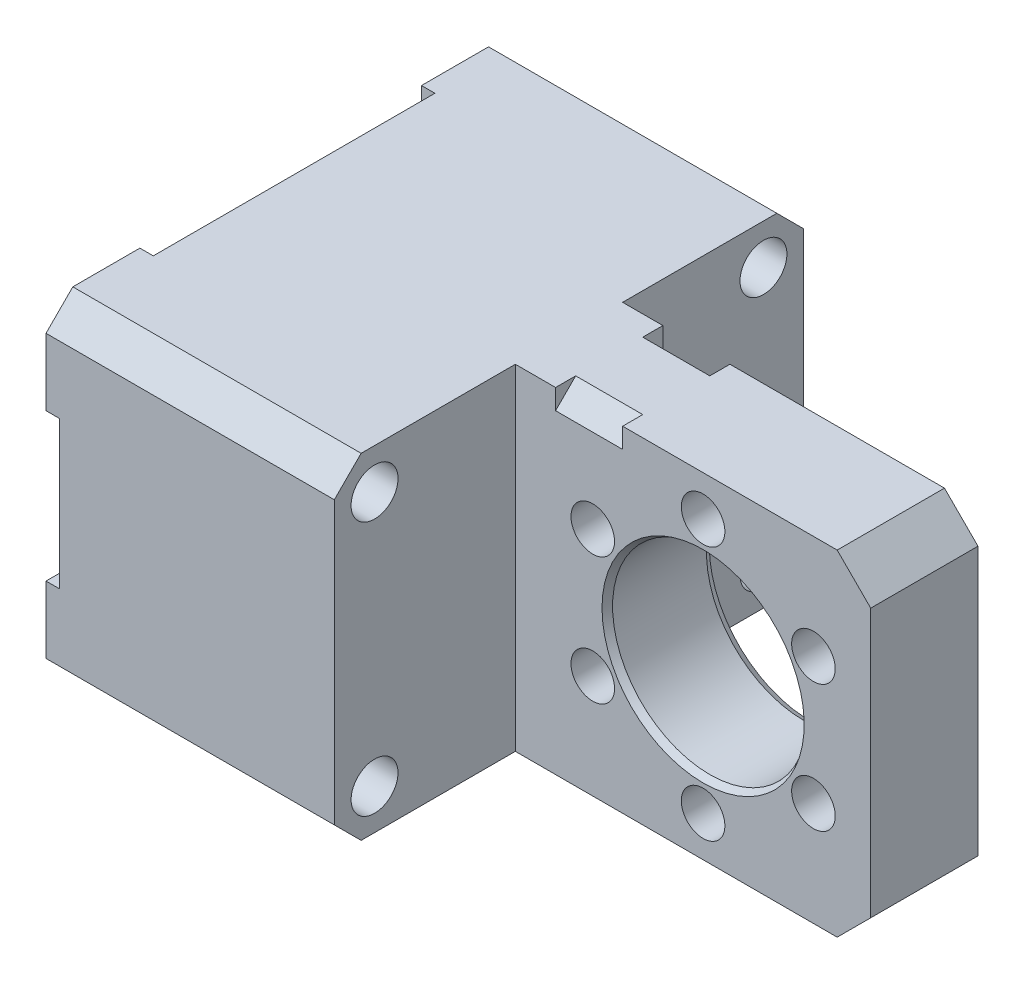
ISO-10303-21;
HEADER;
FILE_DESCRIPTION(('STEP AP214'),'2;1');
FILE_NAME('part.step','',(''),(''),'','','');
FILE_SCHEMA(('AUTOMOTIVE_DESIGN { 1 0 10303 214 1 1 1 1 }'));
ENDSEC;
DATA;
#1=APPLICATION_CONTEXT('core data for automotive mechanical design processes');
#2=APPLICATION_PROTOCOL_DEFINITION('international standard','automotive_design',2000,#1);
#3=PRODUCT_CONTEXT('',#1,'mechanical');
#4=PRODUCT('Part','Part','',(#3));
#5=PRODUCT_RELATED_PRODUCT_CATEGORY('part','',(#4));
#6=PRODUCT_DEFINITION_FORMATION('','',#4);
#7=PRODUCT_DEFINITION_CONTEXT('part definition',#1,'design');
#8=PRODUCT_DEFINITION('design','',#6,#7);
#9=PRODUCT_DEFINITION_SHAPE('','',#8);
#10=(LENGTH_UNIT() NAMED_UNIT(*) SI_UNIT(.MILLI.,.METRE.));
#11=(NAMED_UNIT(*) PLANE_ANGLE_UNIT() SI_UNIT($,.RADIAN.));
#12=(NAMED_UNIT(*) SI_UNIT($,.STERADIAN.) SOLID_ANGLE_UNIT());
#13=UNCERTAINTY_MEASURE_WITH_UNIT(LENGTH_MEASURE(1.E-05),#10,'distance_accuracy_value','');
#14=(GEOMETRIC_REPRESENTATION_CONTEXT(3) GLOBAL_UNCERTAINTY_ASSIGNED_CONTEXT((#13)) GLOBAL_UNIT_ASSIGNED_CONTEXT((#10,
#11,#12)) REPRESENTATION_CONTEXT('',''));
#15=CARTESIAN_POINT('',(0.,0.,0.));
#16=DIRECTION('',(0.,0.,1.));
#17=DIRECTION('',(1.,0.,0.));
#18=AXIS2_PLACEMENT_3D('',#15,#16,#17);
#19=CARTESIAN_POINT('',(0.,25.,0.));
#20=DIRECTION('',(0.,1.,0.));
#21=DIRECTION('',(0.,0.,1.));
#22=AXIS2_PLACEMENT_3D('',#19,#20,#21);
#23=PLANE('',#22);
#24=DIRECTION('',(-1.,0.,0.));
#25=VECTOR('',#24,1.);
#26=CARTESIAN_POINT('',(59.,25.,39.9999999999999));
#27=LINE('',#26,#25);
#28=CARTESIAN_POINT('',(59.,25.,39.9999999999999));
#29=VERTEX_POINT('',#28);
#30=CARTESIAN_POINT('',(49.,25.,39.9999999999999));
#31=VERTEX_POINT('',#30);
#32=EDGE_CURVE('E310',#29,#31,#27,.T.);
#33=ORIENTED_EDGE('',*,*,#32,.F.);
#34=DIRECTION('',(0.,0.,1.));
#35=VECTOR('',#34,1.);
#36=CARTESIAN_POINT('',(59.,25.,43.));
#37=LINE('',#36,#35);
#38=CARTESIAN_POINT('',(59.,25.,43.));
#39=VERTEX_POINT('',#38);
#40=EDGE_CURVE('E297',#29,#39,#37,.T.);
#41=ORIENTED_EDGE('',*,*,#40,.T.);
#42=DIRECTION('',(1.,0.,0.));
#43=VECTOR('',#42,1.);
#44=CARTESIAN_POINT('',(43.,25.,43.));
#45=LINE('',#44,#43);
#46=CARTESIAN_POINT('',(91.,25.,43.));
#47=VERTEX_POINT('',#46);
#48=EDGE_CURVE('E524',#39,#47,#45,.T.);
#49=ORIENTED_EDGE('',*,*,#48,.T.);
#50=DIRECTION('',(0.,0.,-1.));
#51=VECTOR('',#50,1.);
#52=CARTESIAN_POINT('',(91.,25.,27.));
#53=LINE('',#52,#51);
#54=CARTESIAN_POINT('',(91.,25.,27.));
#55=VERTEX_POINT('',#54);
#56=EDGE_CURVE('E623',#47,#55,#53,.T.);
#57=ORIENTED_EDGE('',*,*,#56,.T.);
#58=DIRECTION('',(-1.,0.,0.));
#59=VECTOR('',#58,1.);
#60=CARTESIAN_POINT('',(96.,25.,27.));
#61=LINE('',#60,#59);
#62=CARTESIAN_POINT('',(59.,25.,27.));
#63=VERTEX_POINT('',#62);
#64=EDGE_CURVE('E528',#55,#63,#61,.T.);
#65=ORIENTED_EDGE('',*,*,#64,.T.);
#66=DIRECTION('',(0.,0.,1.));
#67=VECTOR('',#66,1.);
#68=CARTESIAN_POINT('',(59.,25.,30.));
#69=LINE('',#68,#67);
#70=CARTESIAN_POINT('',(59.,25.,30.));
#71=VERTEX_POINT('',#70);
#72=EDGE_CURVE('E331',#63,#71,#69,.T.);
#73=ORIENTED_EDGE('',*,*,#72,.T.);
#74=DIRECTION('',(-1.,0.,0.));
#75=VECTOR('',#74,1.);
#76=CARTESIAN_POINT('',(59.,25.,30.));
#77=LINE('',#76,#75);
#78=CARTESIAN_POINT('',(49.,25.,30.));
#79=VERTEX_POINT('',#78);
#80=EDGE_CURVE('E334',#71,#79,#77,.T.);
#81=ORIENTED_EDGE('',*,*,#80,.T.);
#82=DIRECTION('',(0.,0.,1.));
#83=VECTOR('',#82,1.);
#84=CARTESIAN_POINT('',(49.,25.,30.));
#85=LINE('',#84,#83);
#86=CARTESIAN_POINT('',(49.,25.,27.));
#87=VERTEX_POINT('',#86);
#88=EDGE_CURVE('E328',#87,#79,#85,.T.);
#89=ORIENTED_EDGE('',*,*,#88,.F.);
#90=CARTESIAN_POINT('',(43.,25.,27.));
#91=VERTEX_POINT('',#90);
#92=EDGE_CURVE('E527',#87,#91,#61,.T.);
#93=ORIENTED_EDGE('',*,*,#92,.T.);
#94=DIRECTION('',(0.,0.,-1.));
#95=VECTOR('',#94,1.);
#96=CARTESIAN_POINT('',(43.,25.,27.));
#97=LINE('',#96,#95);
#98=CARTESIAN_POINT('',(43.,25.,3.99999999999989));
#99=VERTEX_POINT('',#98);
#100=EDGE_CURVE('E531',#91,#99,#97,.T.);
#101=ORIENTED_EDGE('',*,*,#100,.T.);
#102=DIRECTION('',(-1.,0.,0.));
#103=VECTOR('',#102,1.);
#104=CARTESIAN_POINT('',(0.,25.,3.99999999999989));
#105=LINE('',#104,#103);
#106=CARTESIAN_POINT('',(0.,25.,3.99999999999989));
#107=VERTEX_POINT('',#106);
#108=EDGE_CURVE('E573',#99,#107,#105,.T.);
#109=ORIENTED_EDGE('',*,*,#108,.T.);
#110=DIRECTION('',(0.,0.,1.));
#111=VECTOR('',#110,1.);
#112=CARTESIAN_POINT('',(0.,25.,0.));
#113=LINE('',#112,#111);
#114=CARTESIAN_POINT('',(0.,25.,14.));
#115=VERTEX_POINT('',#114);
#116=EDGE_CURVE('E518',#107,#115,#113,.T.);
#117=ORIENTED_EDGE('',*,*,#116,.T.);
#118=DIRECTION('',(-1.,0.,0.));
#119=VECTOR('',#118,1.);
#120=CARTESIAN_POINT('',(2.,25.,14.));
#121=LINE('',#120,#119);
#122=CARTESIAN_POINT('',(2.,25.,14.));
#123=VERTEX_POINT('',#122);
#124=EDGE_CURVE('E412',#123,#115,#121,.T.);
#125=ORIENTED_EDGE('',*,*,#124,.F.);
#126=DIRECTION('',(0.,0.,1.));
#127=VECTOR('',#126,1.);
#128=CARTESIAN_POINT('',(2.,25.,0.));
#129=LINE('',#128,#127);
#130=CARTESIAN_POINT('',(2.00000000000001,25.,55.9999999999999));
#131=VERTEX_POINT('',#130);
#132=EDGE_CURVE('E450',#123,#131,#129,.T.);
#133=ORIENTED_EDGE('',*,*,#132,.T.);
#134=DIRECTION('',(-1.,0.,0.));
#135=VECTOR('',#134,1.);
#136=CARTESIAN_POINT('',(2.00000000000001,25.,55.9999999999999));
#137=LINE('',#136,#135);
#138=CARTESIAN_POINT('',(0.,25.,55.9999999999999));
#139=VERTEX_POINT('',#138);
#140=EDGE_CURVE('E439',#131,#139,#137,.T.);
#141=ORIENTED_EDGE('',*,*,#140,.T.);
#142=CARTESIAN_POINT('',(0.,25.,65.9999999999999));
#143=VERTEX_POINT('',#142);
#144=EDGE_CURVE('E522',#139,#143,#113,.T.);
#145=ORIENTED_EDGE('',*,*,#144,.T.);
#146=DIRECTION('',(1.,0.,0.));
#147=VECTOR('',#146,1.);
#148=CARTESIAN_POINT('',(43.,25.,65.9999999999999));
#149=LINE('',#148,#147);
#150=CARTESIAN_POINT('',(43.,25.,65.9999999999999));
#151=VERTEX_POINT('',#150);
#152=EDGE_CURVE('E575',#143,#151,#149,.T.);
#153=ORIENTED_EDGE('',*,*,#152,.T.);
#154=DIRECTION('',(0.,0.,-1.));
#155=VECTOR('',#154,1.);
#156=CARTESIAN_POINT('',(43.,25.,70.));
#157=LINE('',#156,#155);
#158=CARTESIAN_POINT('',(43.,25.,43.));
#159=VERTEX_POINT('',#158);
#160=EDGE_CURVE('E521',#151,#159,#157,.T.);
#161=ORIENTED_EDGE('',*,*,#160,.T.);
#162=CARTESIAN_POINT('',(49.,25.,43.));
#163=VERTEX_POINT('',#162);
#164=EDGE_CURVE('E525',#159,#163,#45,.T.);
#165=ORIENTED_EDGE('',*,*,#164,.T.);
#166=DIRECTION('',(0.,0.,1.));
#167=VECTOR('',#166,1.);
#168=CARTESIAN_POINT('',(49.,25.,43.));
#169=LINE('',#168,#167);
#170=EDGE_CURVE('E78',#31,#163,#169,.T.);
#171=ORIENTED_EDGE('',*,*,#170,.F.);
#172=EDGE_LOOP('',(#33,#41,#49,#57,#65,#73,#81,#89,#93,#101,#109,#117,#125,#133,#141,#145,#153,
#161,#165,#171));
#173=FACE_BOUND('',#172,.T.);
#174=ADVANCED_FACE('F63',(#173),#23,.T.);
#175=CARTESIAN_POINT('',(43.,25.,43.));
#176=DIRECTION('',(0.,0.,-1.));
#177=DIRECTION('',(-1.,0.,0.));
#178=AXIS2_PLACEMENT_3D('',#175,#176,#177);
#179=PLANE('',#178);
#180=CARTESIAN_POINT('',(71.,0.,43.));
#181=DIRECTION('',(0.,0.,-1.));
#182=DIRECTION('',(-1.,0.,0.));
#183=AXIS2_PLACEMENT_3D('',#180,#181,#182);
#184=CIRCLE('',#183,15.0773502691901);
#185=CARTESIAN_POINT('',(55.9226497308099,0.,43.));
#186=VERTEX_POINT('',#185);
#187=EDGE_CURVE('E15',#186,#186,#184,.T.);
#188=ORIENTED_EDGE('',*,*,#187,.T.);
#189=EDGE_LOOP('',(#188));
#190=FACE_BOUND('',#189,.T.);
#191=CARTESIAN_POINT('',(71.,-19.,42.9999999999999));
#192=DIRECTION('',(0.,0.,-1.));
#193=DIRECTION('',(-1.,0.,0.));
#194=AXIS2_PLACEMENT_3D('',#191,#192,#193);
#195=CIRCLE('',#194,3.25000000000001);
#196=CARTESIAN_POINT('',(67.75,-19.,42.9999999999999));
#197=VERTEX_POINT('',#196);
#198=EDGE_CURVE('E490',#197,#197,#195,.T.);
#199=ORIENTED_EDGE('',*,*,#198,.T.);
#200=EDGE_LOOP('',(#199));
#201=FACE_BOUND('',#200,.T.);
#202=CARTESIAN_POINT('',(87.4544826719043,-9.49999999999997,42.9999999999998));
#203=DIRECTION('',(0.,0.,-1.));
#204=DIRECTION('',(-1.,0.,0.));
#205=AXIS2_PLACEMENT_3D('',#202,#203,#204);
#206=CIRCLE('',#205,3.25000000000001);
#207=CARTESIAN_POINT('',(84.2044826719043,-9.49999999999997,42.9999999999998));
#208=VERTEX_POINT('',#207);
#209=EDGE_CURVE('E472',#208,#208,#206,.T.);
#210=ORIENTED_EDGE('',*,*,#209,.T.);
#211=EDGE_LOOP('',(#210));
#212=FACE_BOUND('',#211,.T.);
#213=CARTESIAN_POINT('',(87.4544826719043,9.5000000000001,43.));
#214=DIRECTION('',(0.,0.,-1.));
#215=DIRECTION('',(-1.,0.,0.));
#216=AXIS2_PLACEMENT_3D('',#213,#214,#215);
#217=CIRCLE('',#216,3.25000000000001);
#218=CARTESIAN_POINT('',(84.2044826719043,9.5000000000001,43.));
#219=VERTEX_POINT('',#218);
#220=EDGE_CURVE('E475',#219,#219,#217,.T.);
#221=ORIENTED_EDGE('',*,*,#220,.T.);
#222=EDGE_LOOP('',(#221));
#223=FACE_BOUND('',#222,.T.);
#224=CARTESIAN_POINT('',(71.,19.,43.));
#225=DIRECTION('',(0.,0.,-1.));
#226=DIRECTION('',(-1.,0.,0.));
#227=AXIS2_PLACEMENT_3D('',#224,#225,#226);
#228=CIRCLE('',#227,3.25000000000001);
#229=CARTESIAN_POINT('',(67.75,19.,43.));
#230=VERTEX_POINT('',#229);
#231=EDGE_CURVE('E478',#230,#230,#228,.T.);
#232=ORIENTED_EDGE('',*,*,#231,.T.);
#233=EDGE_LOOP('',(#232));
#234=FACE_BOUND('',#233,.T.);
#235=CARTESIAN_POINT('',(54.5455173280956,9.49999999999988,43.));
#236=DIRECTION('',(0.,0.,-1.));
#237=DIRECTION('',(-1.,0.,0.));
#238=AXIS2_PLACEMENT_3D('',#235,#236,#237);
#239=CIRCLE('',#238,3.25000000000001);
#240=CARTESIAN_POINT('',(51.2955173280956,9.49999999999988,43.));
#241=VERTEX_POINT('',#240);
#242=EDGE_CURVE('E481',#241,#241,#239,.T.);
#243=ORIENTED_EDGE('',*,*,#242,.T.);
#244=EDGE_LOOP('',(#243));
#245=FACE_BOUND('',#244,.T.);
#246=CARTESIAN_POINT('',(54.5455173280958,-9.50000000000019,42.9999999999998));
#247=DIRECTION('',(0.,0.,-1.));
#248=DIRECTION('',(-1.,0.,0.));
#249=AXIS2_PLACEMENT_3D('',#246,#247,#248);
#250=CIRCLE('',#249,3.25000000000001);
#251=CARTESIAN_POINT('',(51.2955173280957,-9.50000000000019,42.9999999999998));
#252=VERTEX_POINT('',#251);
#253=EDGE_CURVE('E484',#252,#252,#250,.T.);
#254=ORIENTED_EDGE('',*,*,#253,.T.);
#255=EDGE_LOOP('',(#254));
#256=FACE_BOUND('',#255,.T.);
#257=DIRECTION('',(0.,-1.,0.));
#258=VECTOR('',#257,1.);
#259=CARTESIAN_POINT('',(59.,22.,43.));
#260=LINE('',#259,#258);
#261=CARTESIAN_POINT('',(59.,22.,43.));
#262=VERTEX_POINT('',#261);
#263=EDGE_CURVE('E302',#39,#262,#260,.T.);
#264=ORIENTED_EDGE('',*,*,#263,.T.);
#265=DIRECTION('',(-1.,0.,0.));
#266=VECTOR('',#265,1.);
#267=CARTESIAN_POINT('',(59.,22.,43.));
#268=LINE('',#267,#266);
#269=CARTESIAN_POINT('',(49.,22.,43.));
#270=VERTEX_POINT('',#269);
#271=EDGE_CURVE('E312',#262,#270,#268,.T.);
#272=ORIENTED_EDGE('',*,*,#271,.T.);
#273=DIRECTION('',(0.,-1.,0.));
#274=VECTOR('',#273,1.);
#275=CARTESIAN_POINT('',(49.,22.,43.));
#276=LINE('',#275,#274);
#277=EDGE_CURVE('E313',#163,#270,#276,.T.);
#278=ORIENTED_EDGE('',*,*,#277,.F.);
#279=ORIENTED_EDGE('',*,*,#164,.F.);
#280=DIRECTION('',(0.,-1.,0.));
#281=VECTOR('',#280,1.);
#282=CARTESIAN_POINT('',(43.,25.,43.));
#283=LINE('',#282,#281);
#284=CARTESIAN_POINT('',(43.,-25.,42.9999999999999));
#285=VERTEX_POINT('',#284);
#286=EDGE_CURVE('E563',#159,#285,#283,.T.);
#287=ORIENTED_EDGE('',*,*,#286,.T.);
#288=DIRECTION('',(1.,0.,0.));
#289=VECTOR('',#288,1.);
#290=CARTESIAN_POINT('',(43.,-25.,42.9999999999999));
#291=LINE('',#290,#289);
#292=CARTESIAN_POINT('',(91.,-25.,42.9999999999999));
#293=VERTEX_POINT('',#292);
#294=EDGE_CURVE('E540',#285,#293,#291,.T.);
#295=ORIENTED_EDGE('',*,*,#294,.T.);
#296=DIRECTION('',(-0.707106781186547,-0.707106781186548,0.));
#297=VECTOR('',#296,1.);
#298=CARTESIAN_POINT('',(96.,-20.,42.9999999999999));
#299=LINE('',#298,#297);
#300=CARTESIAN_POINT('',(96.,-20.,42.9999999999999));
#301=VERTEX_POINT('',#300);
#302=EDGE_CURVE('E621',#293,#301,#299,.F.);
#303=ORIENTED_EDGE('',*,*,#302,.T.);
#304=DIRECTION('',(0.,-1.,0.));
#305=VECTOR('',#304,1.);
#306=CARTESIAN_POINT('',(96.,25.,43.));
#307=LINE('',#306,#305);
#308=CARTESIAN_POINT('',(96.,20.,43.));
#309=VERTEX_POINT('',#308);
#310=EDGE_CURVE('E560',#309,#301,#307,.T.);
#311=ORIENTED_EDGE('',*,*,#310,.F.);
#312=DIRECTION('',(-0.707106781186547,0.707106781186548,0.));
#313=VECTOR('',#312,1.);
#314=CARTESIAN_POINT('',(91.,25.,43.));
#315=LINE('',#314,#313);
#316=EDGE_CURVE('E618',#309,#47,#315,.T.);
#317=ORIENTED_EDGE('',*,*,#316,.T.);
#318=ORIENTED_EDGE('',*,*,#48,.F.);
#319=EDGE_LOOP('',(#264,#272,#278,#279,#287,#295,#303,#311,#317,#318));
#320=FACE_BOUND('',#319,.T.);
#321=ADVANCED_FACE('F655',(#190,#201,#212,#223,#234,#245,#256,#320),#179,.F.);
#322=CARTESIAN_POINT('',(96.,25.,27.));
#323=DIRECTION('',(0.,0.,1.));
#324=DIRECTION('',(1.,0.,0.));
#325=AXIS2_PLACEMENT_3D('',#322,#323,#324);
#326=PLANE('',#325);
#327=CARTESIAN_POINT('',(71.,0.,27.));
#328=DIRECTION('',(0.,0.,1.));
#329=DIRECTION('',(1.,0.,0.));
#330=AXIS2_PLACEMENT_3D('',#327,#328,#329);
#331=CIRCLE('',#330,15.07735026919);
#332=CARTESIAN_POINT('',(86.07735026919,0.,27.));
#333=VERTEX_POINT('',#332);
#334=EDGE_CURVE('E71',#333,#333,#331,.T.);
#335=ORIENTED_EDGE('',*,*,#334,.T.);
#336=EDGE_LOOP('',(#335));
#337=FACE_BOUND('',#336,.T.);
#338=CARTESIAN_POINT('',(71.,-19.,26.9999999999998));
#339=DIRECTION('',(0.,0.,-1.));
#340=DIRECTION('',(-1.,0.,0.));
#341=AXIS2_PLACEMENT_3D('',#338,#339,#340);
#342=CIRCLE('',#341,3.25000000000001);
#343=CARTESIAN_POINT('',(67.75,-19.,26.9999999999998));
#344=VERTEX_POINT('',#343);
#345=EDGE_CURVE('E487',#344,#344,#342,.T.);
#346=ORIENTED_EDGE('',*,*,#345,.F.);
#347=EDGE_LOOP('',(#346));
#348=FACE_BOUND('',#347,.T.);
#349=CARTESIAN_POINT('',(87.4544826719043,-9.49999999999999,26.9999999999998));
#350=DIRECTION('',(0.,0.,-1.));
#351=DIRECTION('',(-0.499999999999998,-0.866025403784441,0.));
#352=AXIS2_PLACEMENT_3D('',#349,#350,#351);
#353=CIRCLE('',#352,3.25000000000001);
#354=CARTESIAN_POINT('',(85.8294826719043,-12.3145825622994,26.9999999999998));
#355=VERTEX_POINT('',#354);
#356=EDGE_CURVE('E461',#355,#355,#353,.T.);
#357=ORIENTED_EDGE('',*,*,#356,.F.);
#358=EDGE_LOOP('',(#357));
#359=FACE_BOUND('',#358,.T.);
#360=CARTESIAN_POINT('',(87.4544826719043,9.50000000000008,27.));
#361=DIRECTION('',(0.,0.,-1.));
#362=DIRECTION('',(0.500000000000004,-0.866025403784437,0.));
#363=AXIS2_PLACEMENT_3D('',#360,#361,#362);
#364=CIRCLE('',#363,3.25000000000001);
#365=CARTESIAN_POINT('',(89.0794826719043,6.68541743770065,27.));
#366=VERTEX_POINT('',#365);
#367=EDGE_CURVE('E458',#366,#366,#364,.T.);
#368=ORIENTED_EDGE('',*,*,#367,.F.);
#369=EDGE_LOOP('',(#368));
#370=FACE_BOUND('',#369,.T.);
#371=CARTESIAN_POINT('',(71.,19.,27.));
#372=DIRECTION('',(0.,0.,-1.));
#373=DIRECTION('',(1.,0.,0.));
#374=AXIS2_PLACEMENT_3D('',#371,#372,#373);
#375=CIRCLE('',#374,3.25000000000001);
#376=CARTESIAN_POINT('',(74.25,19.,27.));
#377=VERTEX_POINT('',#376);
#378=EDGE_CURVE('E462',#377,#377,#375,.T.);
#379=ORIENTED_EDGE('',*,*,#378,.F.);
#380=EDGE_LOOP('',(#379));
#381=FACE_BOUND('',#380,.T.);
#382=CARTESIAN_POINT('',(54.5455173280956,9.49999999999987,27.));
#383=DIRECTION('',(0.,0.,-1.));
#384=DIRECTION('',(0.499999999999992,0.866025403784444,0.));
#385=AXIS2_PLACEMENT_3D('',#382,#383,#384);
#386=CIRCLE('',#385,3.25000000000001);
#387=CARTESIAN_POINT('',(56.1705173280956,12.3145825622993,27.));
#388=VERTEX_POINT('',#387);
#389=EDGE_CURVE('E465',#388,#388,#386,.T.);
#390=ORIENTED_EDGE('',*,*,#389,.F.);
#391=EDGE_LOOP('',(#390));
#392=FACE_BOUND('',#391,.T.);
#393=CARTESIAN_POINT('',(54.5455173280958,-9.50000000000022,26.9999999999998));
#394=DIRECTION('',(0.,0.,-1.));
#395=DIRECTION('',(-0.50000000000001,0.866025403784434,0.));
#396=AXIS2_PLACEMENT_3D('',#393,#394,#395);
#397=CIRCLE('',#396,3.25000000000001);
#398=CARTESIAN_POINT('',(52.9205173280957,-6.6854174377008,26.9999999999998));
#399=VERTEX_POINT('',#398);
#400=EDGE_CURVE('E457',#399,#399,#397,.T.);
#401=ORIENTED_EDGE('',*,*,#400,.F.);
#402=EDGE_LOOP('',(#401));
#403=FACE_BOUND('',#402,.T.);
#404=DIRECTION('',(0.,1.,0.));
#405=VECTOR('',#404,1.);
#406=CARTESIAN_POINT('',(59.,25.,27.));
#407=LINE('',#406,#405);
#408=CARTESIAN_POINT('',(59.,22.,27.));
#409=VERTEX_POINT('',#408);
#410=EDGE_CURVE('E327',#409,#63,#407,.T.);
#411=ORIENTED_EDGE('',*,*,#410,.T.);
#412=ORIENTED_EDGE('',*,*,#64,.F.);
#413=DIRECTION('',(0.707106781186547,-0.707106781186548,0.));
#414=VECTOR('',#413,1.);
#415=CARTESIAN_POINT('',(91.,25.,27.));
#416=LINE('',#415,#414);
#417=CARTESIAN_POINT('',(96.,20.,27.));
#418=VERTEX_POINT('',#417);
#419=EDGE_CURVE('E612',#55,#418,#416,.T.);
#420=ORIENTED_EDGE('',*,*,#419,.T.);
#421=DIRECTION('',(0.,-1.,0.));
#422=VECTOR('',#421,1.);
#423=CARTESIAN_POINT('',(96.,25.,27.));
#424=LINE('',#423,#422);
#425=CARTESIAN_POINT('',(96.,-20.,26.9999999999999));
#426=VERTEX_POINT('',#425);
#427=EDGE_CURVE('E557',#418,#426,#424,.T.);
#428=ORIENTED_EDGE('',*,*,#427,.T.);
#429=DIRECTION('',(0.707106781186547,0.707106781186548,0.));
#430=VECTOR('',#429,1.);
#431=CARTESIAN_POINT('',(96.,-20.,26.9999999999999));
#432=LINE('',#431,#430);
#433=CARTESIAN_POINT('',(91.,-25.,26.9999999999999));
#434=VERTEX_POINT('',#433);
#435=EDGE_CURVE('E614',#426,#434,#432,.F.);
#436=ORIENTED_EDGE('',*,*,#435,.T.);
#437=DIRECTION('',(-1.,0.,0.));
#438=VECTOR('',#437,1.);
#439=CARTESIAN_POINT('',(96.,-25.,26.9999999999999));
#440=LINE('',#439,#438);
#441=CARTESIAN_POINT('',(43.,-25.,26.9999999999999));
#442=VERTEX_POINT('',#441);
#443=EDGE_CURVE('E543',#434,#442,#440,.T.);
#444=ORIENTED_EDGE('',*,*,#443,.T.);
#445=DIRECTION('',(0.,-1.,0.));
#446=VECTOR('',#445,1.);
#447=CARTESIAN_POINT('',(43.,25.,27.));
#448=LINE('',#447,#446);
#449=EDGE_CURVE('E554',#91,#442,#448,.T.);
#450=ORIENTED_EDGE('',*,*,#449,.F.);
#451=ORIENTED_EDGE('',*,*,#92,.F.);
#452=DIRECTION('',(0.,1.,0.));
#453=VECTOR('',#452,1.);
#454=CARTESIAN_POINT('',(49.,25.,27.));
#455=LINE('',#454,#453);
#456=CARTESIAN_POINT('',(49.,22.,27.));
#457=VERTEX_POINT('',#456);
#458=EDGE_CURVE('E336',#457,#87,#455,.T.);
#459=ORIENTED_EDGE('',*,*,#458,.F.);
#460=DIRECTION('',(-1.,0.,0.));
#461=VECTOR('',#460,1.);
#462=CARTESIAN_POINT('',(59.,22.,27.));
#463=LINE('',#462,#461);
#464=EDGE_CURVE('E341',#409,#457,#463,.T.);
#465=ORIENTED_EDGE('',*,*,#464,.F.);
#466=EDGE_LOOP('',(#411,#412,#420,#428,#436,#444,#450,#451,#459,#465));
#467=FACE_BOUND('',#466,.T.);
#468=ADVANCED_FACE('F634',(#337,#348,#359,#370,#381,#392,#403,#467),#326,.F.);
#469=CARTESIAN_POINT('',(0.,25.,0.));
#470=DIRECTION('',(1.,0.,0.));
#471=DIRECTION('',(0.,0.,-1.));
#472=AXIS2_PLACEMENT_3D('',#469,#470,#471);
#473=PLANE('',#472);
#474=CARTESIAN_POINT('',(0.,19.,63.9999999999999));
#475=DIRECTION('',(1.,0.,0.));
#476=DIRECTION('',(0.,0.,-1.));
#477=AXIS2_PLACEMENT_3D('',#474,#475,#476);
#478=CIRCLE('',#477,3.49999999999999);
#479=CARTESIAN_POINT('',(0.,19.,60.5));
#480=VERTEX_POINT('',#479);
#481=EDGE_CURVE('E496',#480,#480,#478,.T.);
#482=ORIENTED_EDGE('',*,*,#481,.T.);
#483=EDGE_LOOP('',(#482));
#484=FACE_BOUND('',#483,.T.);
#485=DIRECTION('',(0.,-1.,0.));
#486=VECTOR('',#485,1.);
#487=CARTESIAN_POINT('',(0.,25.,55.9999999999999));
#488=LINE('',#487,#486);
#489=CARTESIAN_POINT('',(0.,19.,55.9999999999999));
#490=VERTEX_POINT('',#489);
#491=EDGE_CURVE('E414',#139,#490,#488,.T.);
#492=ORIENTED_EDGE('',*,*,#491,.T.);
#493=CARTESIAN_POINT('',(0.,19.,63.9999999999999));
#494=DIRECTION('',(-1.,0.,0.));
#495=DIRECTION('',(0.,0.,-1.));
#496=AXIS2_PLACEMENT_3D('',#493,#494,#495);
#497=CIRCLE('',#496,8.);
#498=CARTESIAN_POINT('',(0.,11.,63.9999999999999));
#499=VERTEX_POINT('',#498);
#500=EDGE_CURVE('E434',#490,#499,#497,.T.);
#501=ORIENTED_EDGE('',*,*,#500,.T.);
#502=DIRECTION('',(0.,0.,1.));
#503=VECTOR('',#502,1.);
#504=CARTESIAN_POINT('',(0.,11.,63.9999999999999));
#505=LINE('',#504,#503);
#506=CARTESIAN_POINT('',(0.,11.,70.));
#507=VERTEX_POINT('',#506);
#508=EDGE_CURVE('E425',#499,#507,#505,.T.);
#509=ORIENTED_EDGE('',*,*,#508,.T.);
#510=DIRECTION('',(0.,-1.,0.));
#511=VECTOR('',#510,1.);
#512=CARTESIAN_POINT('',(0.,25.,70.));
#513=LINE('',#512,#511);
#514=CARTESIAN_POINT('',(0.,21.,70.));
#515=VERTEX_POINT('',#514);
#516=EDGE_CURVE('E570',#515,#507,#513,.T.);
#517=ORIENTED_EDGE('',*,*,#516,.F.);
#518=DIRECTION('',(0.,0.707106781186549,-0.707106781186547));
#519=VECTOR('',#518,1.);
#520=CARTESIAN_POINT('',(0.,25.,65.9999999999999));
#521=LINE('',#520,#519);
#522=EDGE_CURVE('E592',#515,#143,#521,.T.);
#523=ORIENTED_EDGE('',*,*,#522,.T.);
#524=ORIENTED_EDGE('',*,*,#144,.F.);
#525=EDGE_LOOP('',(#492,#501,#509,#517,#523,#524));
#526=FACE_BOUND('',#525,.T.);
#527=ADVANCED_FACE('F788',(#484,#526),#473,.F.);
#528=CARTESIAN_POINT('',(0.,19.,6.00000000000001));
#529=DIRECTION('',(1.,0.,0.));
#530=DIRECTION('',(0.,0.,-1.));
#531=AXIS2_PLACEMENT_3D('',#528,#529,#530);
#532=CIRCLE('',#531,3.49999999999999);
#533=CARTESIAN_POINT('',(0.,19.,2.50000000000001));
#534=VERTEX_POINT('',#533);
#535=EDGE_CURVE('E502',#534,#534,#532,.T.);
#536=ORIENTED_EDGE('',*,*,#535,.T.);
#537=EDGE_LOOP('',(#536));
#538=FACE_BOUND('',#537,.T.);
#539=DIRECTION('',(0.,1.,0.));
#540=VECTOR('',#539,1.);
#541=CARTESIAN_POINT('',(0.,25.,14.));
#542=LINE('',#541,#540);
#543=CARTESIAN_POINT('',(0.,19.,14.));
#544=VERTEX_POINT('',#543);
#545=EDGE_CURVE('E398',#544,#115,#542,.T.);
#546=ORIENTED_EDGE('',*,*,#545,.T.);
#547=ORIENTED_EDGE('',*,*,#116,.F.);
#548=DIRECTION('',(0.,-0.70710678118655,-0.707106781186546));
#549=VECTOR('',#548,1.);
#550=CARTESIAN_POINT('',(0.,25.,3.99999999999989));
#551=LINE('',#550,#549);
#552=CARTESIAN_POINT('',(0.,21.,0.));
#553=VERTEX_POINT('',#552);
#554=EDGE_CURVE('E590',#107,#553,#551,.T.);
#555=ORIENTED_EDGE('',*,*,#554,.T.);
#556=DIRECTION('',(0.,-1.,0.));
#557=VECTOR('',#556,1.);
#558=CARTESIAN_POINT('',(0.,25.,0.));
#559=LINE('',#558,#557);
#560=CARTESIAN_POINT('',(0.,11.,0.));
#561=VERTEX_POINT('',#560);
#562=EDGE_CURVE('E548',#553,#561,#559,.T.);
#563=ORIENTED_EDGE('',*,*,#562,.T.);
#564=DIRECTION('',(0.,0.,1.));
#565=VECTOR('',#564,1.);
#566=CARTESIAN_POINT('',(0.,11.,0.));
#567=LINE('',#566,#565);
#568=CARTESIAN_POINT('',(0.,11.,6.00000000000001));
#569=VERTEX_POINT('',#568);
#570=EDGE_CURVE('E387',#561,#569,#567,.T.);
#571=ORIENTED_EDGE('',*,*,#570,.T.);
#572=CARTESIAN_POINT('',(0.,19.,6.00000000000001));
#573=DIRECTION('',(-1.,0.,0.));
#574=DIRECTION('',(0.,0.,-1.));
#575=AXIS2_PLACEMENT_3D('',#572,#573,#574);
#576=CIRCLE('',#575,8.);
#577=EDGE_CURVE('E407',#569,#544,#576,.T.);
#578=ORIENTED_EDGE('',*,*,#577,.T.);
#579=EDGE_LOOP('',(#546,#547,#555,#563,#571,#578));
#580=FACE_BOUND('',#579,.T.);
#581=ADVANCED_FACE('F728',(#538,#580),#473,.F.);
#582=CARTESIAN_POINT('',(0.,-19.,5.99999999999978));
#583=DIRECTION('',(1.,0.,0.));
#584=DIRECTION('',(0.,0.,-1.));
#585=AXIS2_PLACEMENT_3D('',#582,#583,#584);
#586=CIRCLE('',#585,3.49999999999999);
#587=CARTESIAN_POINT('',(0.,-19.,2.49999999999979));
#588=VERTEX_POINT('',#587);
#589=EDGE_CURVE('E508',#588,#588,#586,.T.);
#590=ORIENTED_EDGE('',*,*,#589,.T.);
#591=EDGE_LOOP('',(#590));
#592=FACE_BOUND('',#591,.T.);
#593=DIRECTION('',(0.,0.,-1.));
#594=VECTOR('',#593,1.);
#595=CARTESIAN_POINT('',(0.,-11.,-2.22044604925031E-13));
#596=LINE('',#595,#594);
#597=CARTESIAN_POINT('',(0.,-11.,5.99999999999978));
#598=VERTEX_POINT('',#597);
#599=CARTESIAN_POINT('',(0.,-11.,-2.22044604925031E-13));
#600=VERTEX_POINT('',#599);
#601=EDGE_CURVE('E371',#598,#600,#596,.T.);
#602=ORIENTED_EDGE('',*,*,#601,.T.);
#603=CARTESIAN_POINT('',(0.,-21.,-2.22044604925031E-13));
#604=VERTEX_POINT('',#603);
#605=EDGE_CURVE('E534',#600,#604,#559,.T.);
#606=ORIENTED_EDGE('',*,*,#605,.T.);
#607=DIRECTION('',(0.,0.707106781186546,-0.70710678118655));
#608=VECTOR('',#607,1.);
#609=CARTESIAN_POINT('',(0.,-21.,-2.22044604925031E-13));
#610=LINE('',#609,#608);
#611=CARTESIAN_POINT('',(0.,-25.,3.99999999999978));
#612=VERTEX_POINT('',#611);
#613=EDGE_CURVE('E588',#604,#612,#610,.F.);
#614=ORIENTED_EDGE('',*,*,#613,.T.);
#615=DIRECTION('',(0.,0.,1.));
#616=VECTOR('',#615,1.);
#617=CARTESIAN_POINT('',(0.,-25.,-2.22044604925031E-13));
#618=LINE('',#617,#616);
#619=CARTESIAN_POINT('',(0.,-25.,13.9999999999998));
#620=VERTEX_POINT('',#619);
#621=EDGE_CURVE('E535',#612,#620,#618,.T.);
#622=ORIENTED_EDGE('',*,*,#621,.T.);
#623=DIRECTION('',(0.,1.,0.));
#624=VECTOR('',#623,1.);
#625=CARTESIAN_POINT('',(0.,-19.,13.9999999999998));
#626=LINE('',#625,#624);
#627=CARTESIAN_POINT('',(0.,-19.,13.9999999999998));
#628=VERTEX_POINT('',#627);
#629=EDGE_CURVE('E360',#620,#628,#626,.T.);
#630=ORIENTED_EDGE('',*,*,#629,.T.);
#631=CARTESIAN_POINT('',(0.,-19.,5.99999999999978));
#632=DIRECTION('',(-1.,0.,0.));
#633=DIRECTION('',(0.,0.,1.));
#634=AXIS2_PLACEMENT_3D('',#631,#632,#633);
#635=CIRCLE('',#634,8.);
#636=EDGE_CURVE('E380',#628,#598,#635,.T.);
#637=ORIENTED_EDGE('',*,*,#636,.T.);
#638=EDGE_LOOP('',(#602,#606,#614,#622,#630,#637));
#639=FACE_BOUND('',#638,.T.);
#640=ADVANCED_FACE('F755',(#592,#639),#473,.F.);
#641=CARTESIAN_POINT('',(0.,-19.,63.9999999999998));
#642=DIRECTION('',(1.,0.,0.));
#643=DIRECTION('',(0.,0.,-1.));
#644=AXIS2_PLACEMENT_3D('',#641,#642,#643);
#645=CIRCLE('',#644,3.49999999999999);
#646=CARTESIAN_POINT('',(0.,-19.,60.4999999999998));
#647=VERTEX_POINT('',#646);
#648=EDGE_CURVE('E514',#647,#647,#645,.T.);
#649=ORIENTED_EDGE('',*,*,#648,.T.);
#650=EDGE_LOOP('',(#649));
#651=FACE_BOUND('',#650,.T.);
#652=DIRECTION('',(0.,-1.,0.));
#653=VECTOR('',#652,1.);
#654=CARTESIAN_POINT('',(0.,-19.,55.9999999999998));
#655=LINE('',#654,#653);
#656=CARTESIAN_POINT('',(0.,-19.,55.9999999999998));
#657=VERTEX_POINT('',#656);
#658=CARTESIAN_POINT('',(0.,-25.,55.9999999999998));
#659=VERTEX_POINT('',#658);
#660=EDGE_CURVE('E348',#657,#659,#655,.T.);
#661=ORIENTED_EDGE('',*,*,#660,.T.);
#662=CARTESIAN_POINT('',(0.,-25.,65.9999999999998));
#663=VERTEX_POINT('',#662);
#664=EDGE_CURVE('E517',#659,#663,#618,.T.);
#665=ORIENTED_EDGE('',*,*,#664,.T.);
#666=DIRECTION('',(0.,-0.707106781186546,-0.70710678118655));
#667=VECTOR('',#666,1.);
#668=CARTESIAN_POINT('',(0.,-21.0000000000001,69.9999999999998));
#669=LINE('',#668,#667);
#670=CARTESIAN_POINT('',(0.,-21.0000000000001,69.9999999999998));
#671=VERTEX_POINT('',#670);
#672=EDGE_CURVE('E585',#663,#671,#669,.F.);
#673=ORIENTED_EDGE('',*,*,#672,.T.);
#674=CARTESIAN_POINT('',(0.,-11.,69.9999999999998));
#675=VERTEX_POINT('',#674);
#676=EDGE_CURVE('E569',#675,#671,#513,.T.);
#677=ORIENTED_EDGE('',*,*,#676,.F.);
#678=DIRECTION('',(0.,0.,-1.));
#679=VECTOR('',#678,1.);
#680=CARTESIAN_POINT('',(0.,-11.,63.9999999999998));
#681=LINE('',#680,#679);
#682=CARTESIAN_POINT('',(0.,-11.,63.9999999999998));
#683=VERTEX_POINT('',#682);
#684=EDGE_CURVE('E316',#675,#683,#681,.T.);
#685=ORIENTED_EDGE('',*,*,#684,.T.);
#686=CARTESIAN_POINT('',(0.,-19.,63.9999999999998));
#687=DIRECTION('',(-1.,0.,0.));
#688=DIRECTION('',(0.,0.,-1.));
#689=AXIS2_PLACEMENT_3D('',#686,#687,#688);
#690=CIRCLE('',#689,8.);
#691=EDGE_CURVE('E319',#683,#657,#690,.T.);
#692=ORIENTED_EDGE('',*,*,#691,.T.);
#693=EDGE_LOOP('',(#661,#665,#673,#677,#685,#692));
#694=FACE_BOUND('',#693,.T.);
#695=ADVANCED_FACE('F808',(#651,#694),#473,.F.);
#696=CARTESIAN_POINT('',(0.,25.,70.));
#697=DIRECTION('',(0.,0.,-1.));
#698=DIRECTION('',(-1.,0.,0.));
#699=AXIS2_PLACEMENT_3D('',#696,#697,#698);
#700=PLANE('',#699);
#701=DIRECTION('',(-1.,0.,0.));
#702=VECTOR('',#701,1.);
#703=CARTESIAN_POINT('',(2.00000000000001,11.,70.));
#704=LINE('',#703,#702);
#705=CARTESIAN_POINT('',(2.00000000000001,11.,70.));
#706=VERTEX_POINT('',#705);
#707=EDGE_CURVE('E443',#706,#507,#704,.T.);
#708=ORIENTED_EDGE('',*,*,#707,.F.);
#709=DIRECTION('',(0.,1.,0.));
#710=VECTOR('',#709,1.);
#711=CARTESIAN_POINT('',(2.00000000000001,25.,70.));
#712=LINE('',#711,#710);
#713=CARTESIAN_POINT('',(2.00000000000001,-11.,69.9999999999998));
#714=VERTEX_POINT('',#713);
#715=EDGE_CURVE('E455',#714,#706,#712,.T.);
#716=ORIENTED_EDGE('',*,*,#715,.F.);
#717=DIRECTION('',(-1.,0.,0.));
#718=VECTOR('',#717,1.);
#719=CARTESIAN_POINT('',(2.00000000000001,-11.,69.9999999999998));
#720=LINE('',#719,#718);
#721=EDGE_CURVE('E352',#714,#675,#720,.T.);
#722=ORIENTED_EDGE('',*,*,#721,.T.);
#723=ORIENTED_EDGE('',*,*,#676,.T.);
#724=DIRECTION('',(1.,0.,0.));
#725=VECTOR('',#724,1.);
#726=CARTESIAN_POINT('',(0.,-21.0000000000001,69.9999999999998));
#727=LINE('',#726,#725);
#728=CARTESIAN_POINT('',(43.,-21.0000000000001,69.9999999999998));
#729=VERTEX_POINT('',#728);
#730=EDGE_CURVE('E581',#671,#729,#727,.T.);
#731=ORIENTED_EDGE('',*,*,#730,.T.);
#732=DIRECTION('',(0.,-1.,0.));
#733=VECTOR('',#732,1.);
#734=CARTESIAN_POINT('',(43.,25.,70.));
#735=LINE('',#734,#733);
#736=CARTESIAN_POINT('',(43.,21.,70.));
#737=VERTEX_POINT('',#736);
#738=EDGE_CURVE('E566',#737,#729,#735,.T.);
#739=ORIENTED_EDGE('',*,*,#738,.F.);
#740=DIRECTION('',(-1.,0.,0.));
#741=VECTOR('',#740,1.);
#742=CARTESIAN_POINT('',(0.,21.,70.));
#743=LINE('',#742,#741);
#744=EDGE_CURVE('E583',#737,#515,#743,.T.);
#745=ORIENTED_EDGE('',*,*,#744,.T.);
#746=ORIENTED_EDGE('',*,*,#516,.T.);
#747=EDGE_LOOP('',(#708,#716,#722,#723,#731,#739,#745,#746));
#748=FACE_BOUND('',#747,.T.);
#749=ADVANCED_FACE('F780',(#748),#700,.F.);
#750=CARTESIAN_POINT('',(43.,25.,70.));
#751=DIRECTION('',(-1.,0.,0.));
#752=DIRECTION('',(0.,0.,1.));
#753=AXIS2_PLACEMENT_3D('',#750,#751,#752);
#754=PLANE('',#753);
#755=CARTESIAN_POINT('',(43.,19.,63.9999999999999));
#756=DIRECTION('',(1.,0.,0.));
#757=DIRECTION('',(0.,0.,-1.));
#758=AXIS2_PLACEMENT_3D('',#755,#756,#757);
#759=CIRCLE('',#758,3.5);
#760=CARTESIAN_POINT('',(43.,19.,60.5));
#761=VERTEX_POINT('',#760);
#762=EDGE_CURVE('E493',#761,#761,#759,.T.);
#763=ORIENTED_EDGE('',*,*,#762,.F.);
#764=EDGE_LOOP('',(#763));
#765=FACE_BOUND('',#764,.T.);
#766=CARTESIAN_POINT('',(43.,-19.,63.9999999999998));
#767=DIRECTION('',(1.,0.,0.));
#768=DIRECTION('',(0.,0.,-1.));
#769=AXIS2_PLACEMENT_3D('',#766,#767,#768);
#770=CIRCLE('',#769,3.5);
#771=CARTESIAN_POINT('',(43.,-19.,60.4999999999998));
#772=VERTEX_POINT('',#771);
#773=EDGE_CURVE('E511',#772,#772,#770,.T.);
#774=ORIENTED_EDGE('',*,*,#773,.F.);
#775=EDGE_LOOP('',(#774));
#776=FACE_BOUND('',#775,.T.);
#777=ORIENTED_EDGE('',*,*,#160,.F.);
#778=DIRECTION('',(0.,-0.707106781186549,0.707106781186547));
#779=VECTOR('',#778,1.);
#780=CARTESIAN_POINT('',(43.,25.,65.9999999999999));
#781=LINE('',#780,#779);
#782=EDGE_CURVE('E579',#151,#737,#781,.T.);
#783=ORIENTED_EDGE('',*,*,#782,.T.);
#784=ORIENTED_EDGE('',*,*,#738,.T.);
#785=DIRECTION('',(0.,0.707106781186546,0.70710678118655));
#786=VECTOR('',#785,1.);
#787=CARTESIAN_POINT('',(43.,-21.0000000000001,69.9999999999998));
#788=LINE('',#787,#786);
#789=CARTESIAN_POINT('',(43.,-25.,65.9999999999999));
#790=VERTEX_POINT('',#789);
#791=EDGE_CURVE('E577',#729,#790,#788,.F.);
#792=ORIENTED_EDGE('',*,*,#791,.T.);
#793=DIRECTION('',(0.,0.,-1.));
#794=VECTOR('',#793,1.);
#795=CARTESIAN_POINT('',(43.,-25.,70.));
#796=LINE('',#795,#794);
#797=EDGE_CURVE('E538',#790,#285,#796,.T.);
#798=ORIENTED_EDGE('',*,*,#797,.T.);
#799=ORIENTED_EDGE('',*,*,#286,.F.);
#800=EDGE_LOOP('',(#777,#783,#784,#792,#798,#799));
#801=FACE_BOUND('',#800,.T.);
#802=ADVANCED_FACE('F680',(#765,#776,#801),#754,.F.);
#803=CARTESIAN_POINT('',(96.,25.,27.));
#804=DIRECTION('',(-1.,0.,0.));
#805=DIRECTION('',(0.,0.,1.));
#806=AXIS2_PLACEMENT_3D('',#803,#804,#805);
#807=PLANE('',#806);
#808=ORIENTED_EDGE('',*,*,#310,.T.);
#809=DIRECTION('',(0.,0.,-1.));
#810=VECTOR('',#809,1.);
#811=CARTESIAN_POINT('',(96.,-20.,26.9999999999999));
#812=LINE('',#811,#810);
#813=EDGE_CURVE('E609',#301,#426,#812,.T.);
#814=ORIENTED_EDGE('',*,*,#813,.T.);
#815=ORIENTED_EDGE('',*,*,#427,.F.);
#816=DIRECTION('',(0.,0.,1.));
#817=VECTOR('',#816,1.);
#818=CARTESIAN_POINT('',(96.,20.,43.));
#819=LINE('',#818,#817);
#820=EDGE_CURVE('E607',#418,#309,#819,.T.);
#821=ORIENTED_EDGE('',*,*,#820,.T.);
#822=EDGE_LOOP('',(#808,#814,#815,#821));
#823=FACE_BOUND('',#822,.T.);
#824=ADVANCED_FACE('F697',(#823),#807,.F.);
#825=CARTESIAN_POINT('',(43.,25.,27.));
#826=DIRECTION('',(-1.,0.,0.));
#827=DIRECTION('',(0.,0.,1.));
#828=AXIS2_PLACEMENT_3D('',#825,#826,#827);
#829=PLANE('',#828);
#830=CARTESIAN_POINT('',(43.,19.,6.00000000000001));
#831=DIRECTION('',(1.,0.,0.));
#832=DIRECTION('',(0.,0.,-1.));
#833=AXIS2_PLACEMENT_3D('',#830,#831,#832);
#834=CIRCLE('',#833,3.5);
#835=CARTESIAN_POINT('',(43.,19.,2.50000000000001));
#836=VERTEX_POINT('',#835);
#837=EDGE_CURVE('E499',#836,#836,#834,.T.);
#838=ORIENTED_EDGE('',*,*,#837,.F.);
#839=EDGE_LOOP('',(#838));
#840=FACE_BOUND('',#839,.T.);
#841=CARTESIAN_POINT('',(43.,-19.,5.99999999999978));
#842=DIRECTION('',(1.,0.,0.));
#843=DIRECTION('',(0.,0.,-1.));
#844=AXIS2_PLACEMENT_3D('',#841,#842,#843);
#845=CIRCLE('',#844,3.5);
#846=CARTESIAN_POINT('',(43.,-19.,2.49999999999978));
#847=VERTEX_POINT('',#846);
#848=EDGE_CURVE('E505',#847,#847,#845,.T.);
#849=ORIENTED_EDGE('',*,*,#848,.F.);
#850=EDGE_LOOP('',(#849));
#851=FACE_BOUND('',#850,.T.);
#852=DIRECTION('',(0.,-1.,0.));
#853=VECTOR('',#852,1.);
#854=CARTESIAN_POINT('',(43.,25.,0.));
#855=LINE('',#854,#853);
#856=CARTESIAN_POINT('',(43.,21.,0.));
#857=VERTEX_POINT('',#856);
#858=CARTESIAN_POINT('',(43.,-21.,-2.22044604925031E-13));
#859=VERTEX_POINT('',#858);
#860=EDGE_CURVE('E551',#857,#859,#855,.T.);
#861=ORIENTED_EDGE('',*,*,#860,.F.);
#862=DIRECTION('',(0.,0.70710678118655,0.707106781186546));
#863=VECTOR('',#862,1.);
#864=CARTESIAN_POINT('',(43.,25.,3.99999999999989));
#865=LINE('',#864,#863);
#866=EDGE_CURVE('E601',#857,#99,#865,.T.);
#867=ORIENTED_EDGE('',*,*,#866,.T.);
#868=ORIENTED_EDGE('',*,*,#100,.F.);
#869=ORIENTED_EDGE('',*,*,#449,.T.);
#870=DIRECTION('',(0.,0.,-1.));
#871=VECTOR('',#870,1.);
#872=CARTESIAN_POINT('',(43.,-25.,26.9999999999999));
#873=LINE('',#872,#871);
#874=CARTESIAN_POINT('',(43.,-25.,3.99999999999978));
#875=VERTEX_POINT('',#874);
#876=EDGE_CURVE('E545',#442,#875,#873,.T.);
#877=ORIENTED_EDGE('',*,*,#876,.T.);
#878=DIRECTION('',(0.,-0.707106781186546,0.70710678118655));
#879=VECTOR('',#878,1.);
#880=CARTESIAN_POINT('',(43.,-21.,-2.22044604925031E-13));
#881=LINE('',#880,#879);
#882=EDGE_CURVE('E599',#875,#859,#881,.F.);
#883=ORIENTED_EDGE('',*,*,#882,.T.);
#884=EDGE_LOOP('',(#861,#867,#868,#869,#877,#883));
#885=FACE_BOUND('',#884,.T.);
#886=ADVANCED_FACE('F718',(#840,#851,#885),#829,.F.);
#887=CARTESIAN_POINT('',(0.,25.,0.));
#888=DIRECTION('',(0.,0.,1.));
#889=DIRECTION('',(1.,0.,0.));
#890=AXIS2_PLACEMENT_3D('',#887,#888,#889);
#891=PLANE('',#890);
#892=DIRECTION('',(-1.,0.,0.));
#893=VECTOR('',#892,1.);
#894=CARTESIAN_POINT('',(2.,-11.,-2.22044604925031E-13));
#895=LINE('',#894,#893);
#896=CARTESIAN_POINT('',(2.,-11.,-2.22044604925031E-13));
#897=VERTEX_POINT('',#896);
#898=EDGE_CURVE('E385',#897,#600,#895,.T.);
#899=ORIENTED_EDGE('',*,*,#898,.F.);
#900=DIRECTION('',(0.,-1.,0.));
#901=VECTOR('',#900,1.);
#902=CARTESIAN_POINT('',(2.,25.,0.));
#903=LINE('',#902,#901);
#904=CARTESIAN_POINT('',(2.,11.,0.));
#905=VERTEX_POINT('',#904);
#906=EDGE_CURVE('E453',#905,#897,#903,.T.);
#907=ORIENTED_EDGE('',*,*,#906,.F.);
#908=DIRECTION('',(-1.,0.,0.));
#909=VECTOR('',#908,1.);
#910=CARTESIAN_POINT('',(2.,11.,0.));
#911=LINE('',#910,#909);
#912=EDGE_CURVE('E404',#905,#561,#911,.T.);
#913=ORIENTED_EDGE('',*,*,#912,.T.);
#914=ORIENTED_EDGE('',*,*,#562,.F.);
#915=DIRECTION('',(1.,0.,0.));
#916=VECTOR('',#915,1.);
#917=CARTESIAN_POINT('',(43.,21.,0.));
#918=LINE('',#917,#916);
#919=EDGE_CURVE('E597',#553,#857,#918,.T.);
#920=ORIENTED_EDGE('',*,*,#919,.T.);
#921=ORIENTED_EDGE('',*,*,#860,.T.);
#922=DIRECTION('',(-1.,0.,0.));
#923=VECTOR('',#922,1.);
#924=CARTESIAN_POINT('',(0.,-21.,-2.22044604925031E-13));
#925=LINE('',#924,#923);
#926=EDGE_CURVE('E595',#859,#604,#925,.T.);
#927=ORIENTED_EDGE('',*,*,#926,.T.);
#928=ORIENTED_EDGE('',*,*,#605,.F.);
#929=EDGE_LOOP('',(#899,#907,#913,#914,#920,#921,#927,#928));
#930=FACE_BOUND('',#929,.T.);
#931=ADVANCED_FACE('F748',(#930),#891,.F.);
#932=CARTESIAN_POINT('',(0.,-25.,-2.22044604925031E-13));
#933=DIRECTION('',(0.,1.,0.));
#934=DIRECTION('',(0.,0.,1.));
#935=AXIS2_PLACEMENT_3D('',#932,#933,#934);
#936=PLANE('',#935);
#937=DIRECTION('',(-1.,0.,0.));
#938=VECTOR('',#937,1.);
#939=CARTESIAN_POINT('',(2.00000000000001,-25.,55.9999999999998));
#940=LINE('',#939,#938);
#941=CARTESIAN_POINT('',(2.00000000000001,-25.,55.9999999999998));
#942=VERTEX_POINT('',#941);
#943=EDGE_CURVE('E358',#942,#659,#940,.T.);
#944=ORIENTED_EDGE('',*,*,#943,.F.);
#945=DIRECTION('',(0.,0.,1.));
#946=VECTOR('',#945,1.);
#947=CARTESIAN_POINT('',(2.,-25.,-2.22044604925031E-13));
#948=LINE('',#947,#946);
#949=CARTESIAN_POINT('',(2.00000000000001,-25.,13.9999999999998));
#950=VERTEX_POINT('',#949);
#951=EDGE_CURVE('E442',#950,#942,#948,.T.);
#952=ORIENTED_EDGE('',*,*,#951,.F.);
#953=DIRECTION('',(-1.,0.,0.));
#954=VECTOR('',#953,1.);
#955=CARTESIAN_POINT('',(2.,-25.,13.9999999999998));
#956=LINE('',#955,#954);
#957=EDGE_CURVE('E377',#950,#620,#956,.T.);
#958=ORIENTED_EDGE('',*,*,#957,.T.);
#959=ORIENTED_EDGE('',*,*,#621,.F.);
#960=DIRECTION('',(1.,0.,0.));
#961=VECTOR('',#960,1.);
#962=CARTESIAN_POINT('',(0.,-25.,3.99999999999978));
#963=LINE('',#962,#961);
#964=EDGE_CURVE('E605',#612,#875,#963,.T.);
#965=ORIENTED_EDGE('',*,*,#964,.T.);
#966=ORIENTED_EDGE('',*,*,#876,.F.);
#967=ORIENTED_EDGE('',*,*,#443,.F.);
#968=DIRECTION('',(0.,0.,1.));
#969=VECTOR('',#968,1.);
#970=CARTESIAN_POINT('',(91.,-25.,0.));
#971=LINE('',#970,#969);
#972=EDGE_CURVE('E616',#434,#293,#971,.T.);
#973=ORIENTED_EDGE('',*,*,#972,.T.);
#974=ORIENTED_EDGE('',*,*,#294,.F.);
#975=ORIENTED_EDGE('',*,*,#797,.F.);
#976=DIRECTION('',(-1.,0.,0.));
#977=VECTOR('',#976,1.);
#978=CARTESIAN_POINT('',(0.,-25.,65.9999999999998));
#979=LINE('',#978,#977);
#980=EDGE_CURVE('E603',#790,#663,#979,.T.);
#981=ORIENTED_EDGE('',*,*,#980,.T.);
#982=ORIENTED_EDGE('',*,*,#664,.F.);
#983=EDGE_LOOP('',(#944,#952,#958,#959,#965,#966,#967,#973,#974,#975,#981,#982));
#984=FACE_BOUND('',#983,.T.);
#985=ADVANCED_FACE('F686',(#984),#936,.F.);
#986=CARTESIAN_POINT('',(43.,-19.,63.9999999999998));
#987=DIRECTION('',(1.,0.,0.));
#988=DIRECTION('',(0.,0.,-1.));
#989=AXIS2_PLACEMENT_3D('',#986,#987,#988);
#990=CYLINDRICAL_SURFACE('',#989,3.49999999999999);
#991=ORIENTED_EDGE('',*,*,#648,.F.);
#992=EDGE_LOOP('',(#991));
#993=FACE_BOUND('',#992,.T.);
#994=ORIENTED_EDGE('',*,*,#773,.T.);
#995=EDGE_LOOP('',(#994));
#996=FACE_BOUND('',#995,.T.);
#997=ADVANCED_FACE('F826',(#993,#996),#990,.F.);
#998=CARTESIAN_POINT('',(43.,-19.,5.99999999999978));
#999=DIRECTION('',(1.,0.,0.));
#1000=DIRECTION('',(0.,0.,-1.));
#1001=AXIS2_PLACEMENT_3D('',#998,#999,#1000);
#1002=CYLINDRICAL_SURFACE('',#1001,3.49999999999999);
#1003=ORIENTED_EDGE('',*,*,#589,.F.);
#1004=EDGE_LOOP('',(#1003));
#1005=FACE_BOUND('',#1004,.T.);
#1006=ORIENTED_EDGE('',*,*,#848,.T.);
#1007=EDGE_LOOP('',(#1006));
#1008=FACE_BOUND('',#1007,.T.);
#1009=ADVANCED_FACE('F898',(#1005,#1008),#1002,.F.);
#1010=CARTESIAN_POINT('',(43.,19.,6.00000000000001));
#1011=DIRECTION('',(1.,0.,0.));
#1012=DIRECTION('',(0.,0.,-1.));
#1013=AXIS2_PLACEMENT_3D('',#1010,#1011,#1012);
#1014=CYLINDRICAL_SURFACE('',#1013,3.49999999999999);
#1015=ORIENTED_EDGE('',*,*,#535,.F.);
#1016=EDGE_LOOP('',(#1015));
#1017=FACE_BOUND('',#1016,.T.);
#1018=ORIENTED_EDGE('',*,*,#837,.T.);
#1019=EDGE_LOOP('',(#1018));
#1020=FACE_BOUND('',#1019,.T.);
#1021=ADVANCED_FACE('F895',(#1017,#1020),#1014,.F.);
#1022=CARTESIAN_POINT('',(43.,19.,63.9999999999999));
#1023=DIRECTION('',(1.,0.,0.));
#1024=DIRECTION('',(0.,0.,-1.));
#1025=AXIS2_PLACEMENT_3D('',#1022,#1023,#1024);
#1026=CYLINDRICAL_SURFACE('',#1025,3.49999999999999);
#1027=ORIENTED_EDGE('',*,*,#481,.F.);
#1028=EDGE_LOOP('',(#1027));
#1029=FACE_BOUND('',#1028,.T.);
#1030=ORIENTED_EDGE('',*,*,#762,.T.);
#1031=EDGE_LOOP('',(#1030));
#1032=FACE_BOUND('',#1031,.T.);
#1033=ADVANCED_FACE('F647',(#1029,#1032),#1026,.F.);
#1034=CARTESIAN_POINT('',(71.,0.,57.));
#1035=DIRECTION('',(0.,0.,-1.));
#1036=DIRECTION('',(-1.,0.,0.));
#1037=AXIS2_PLACEMENT_3D('',#1034,#1035,#1036);
#1038=CYLINDRICAL_SURFACE('',#1037,14.5);
#1039=CARTESIAN_POINT('',(71.,0.,28.0000000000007));
#1040=DIRECTION('',(0.,0.,1.));
#1041=DIRECTION('',(0.,-1.,0.));
#1042=AXIS2_PLACEMENT_3D('',#1039,#1040,#1041);
#1043=CIRCLE('',#1042,14.5);
#1044=CARTESIAN_POINT('',(71.,-14.5,28.0000000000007));
#1045=VERTEX_POINT('',#1044);
#1046=EDGE_CURVE('E629',#1045,#1045,#1043,.F.);
#1047=ORIENTED_EDGE('',*,*,#1046,.T.);
#1048=EDGE_LOOP('',(#1047));
#1049=FACE_BOUND('',#1048,.T.);
#1050=CARTESIAN_POINT('',(71.,0.,41.9999999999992));
#1051=DIRECTION('',(0.,0.,-1.));
#1052=DIRECTION('',(0.,1.,0.));
#1053=AXIS2_PLACEMENT_3D('',#1050,#1051,#1052);
#1054=CIRCLE('',#1053,14.5);
#1055=CARTESIAN_POINT('',(71.,14.5,41.9999999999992));
#1056=VERTEX_POINT('',#1055);
#1057=EDGE_CURVE('E626',#1056,#1056,#1054,.F.);
#1058=ORIENTED_EDGE('',*,*,#1057,.T.);
#1059=EDGE_LOOP('',(#1058));
#1060=FACE_BOUND('',#1059,.T.);
#1061=ADVANCED_FACE('F643',(#1049,#1060),#1038,.F.);
#1062=CARTESIAN_POINT('',(71.,-19.,56.9999999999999));
#1063=DIRECTION('',(0.,0.,-1.));
#1064=DIRECTION('',(-1.,0.,0.));
#1065=AXIS2_PLACEMENT_3D('',#1062,#1063,#1064);
#1066=CYLINDRICAL_SURFACE('',#1065,3.25000000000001);
#1067=ORIENTED_EDGE('',*,*,#345,.T.);
#1068=EDGE_LOOP('',(#1067));
#1069=FACE_BOUND('',#1068,.T.);
#1070=ORIENTED_EDGE('',*,*,#198,.F.);
#1071=EDGE_LOOP('',(#1070));
#1072=FACE_BOUND('',#1071,.T.);
#1073=ADVANCED_FACE('F646',(#1069,#1072),#1066,.F.);
#1074=CARTESIAN_POINT('',(87.4544826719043,-9.49999999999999,56.9999999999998));
#1075=DIRECTION('',(0.,0.,-1.));
#1076=DIRECTION('',(0.,1.,0.));
#1077=AXIS2_PLACEMENT_3D('',#1074,#1075,#1076);
#1078=CYLINDRICAL_SURFACE('',#1077,3.25000000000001);
#1079=ORIENTED_EDGE('',*,*,#356,.T.);
#1080=EDGE_LOOP('',(#1079));
#1081=FACE_BOUND('',#1080,.T.);
#1082=ORIENTED_EDGE('',*,*,#209,.F.);
#1083=EDGE_LOOP('',(#1082));
#1084=FACE_BOUND('',#1083,.T.);
#1085=ADVANCED_FACE('F875',(#1081,#1084),#1078,.F.);
#1086=CARTESIAN_POINT('',(87.4544826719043,9.5000000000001,57.));
#1087=DIRECTION('',(0.,0.,-1.));
#1088=DIRECTION('',(0.,1.,0.));
#1089=AXIS2_PLACEMENT_3D('',#1086,#1087,#1088);
#1090=CYLINDRICAL_SURFACE('',#1089,3.25000000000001);
#1091=ORIENTED_EDGE('',*,*,#367,.T.);
#1092=EDGE_LOOP('',(#1091));
#1093=FACE_BOUND('',#1092,.T.);
#1094=ORIENTED_EDGE('',*,*,#220,.F.);
#1095=EDGE_LOOP('',(#1094));
#1096=FACE_BOUND('',#1095,.T.);
#1097=ADVANCED_FACE('F871',(#1093,#1096),#1090,.F.);
#1098=CARTESIAN_POINT('',(71.,19.,57.));
#1099=DIRECTION('',(0.,0.,-1.));
#1100=DIRECTION('',(-1.,0.,0.));
#1101=AXIS2_PLACEMENT_3D('',#1098,#1099,#1100);
#1102=CYLINDRICAL_SURFACE('',#1101,3.25000000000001);
#1103=ORIENTED_EDGE('',*,*,#378,.T.);
#1104=EDGE_LOOP('',(#1103));
#1105=FACE_BOUND('',#1104,.T.);
#1106=ORIENTED_EDGE('',*,*,#231,.F.);
#1107=EDGE_LOOP('',(#1106));
#1108=FACE_BOUND('',#1107,.T.);
#1109=ADVANCED_FACE('F874',(#1105,#1108),#1102,.F.);
#1110=CARTESIAN_POINT('',(54.5455173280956,9.49999999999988,57.));
#1111=DIRECTION('',(0.,0.,-1.));
#1112=DIRECTION('',(0.,1.,0.));
#1113=AXIS2_PLACEMENT_3D('',#1110,#1111,#1112);
#1114=CYLINDRICAL_SURFACE('',#1113,3.25000000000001);
#1115=ORIENTED_EDGE('',*,*,#389,.T.);
#1116=EDGE_LOOP('',(#1115));
#1117=FACE_BOUND('',#1116,.T.);
#1118=ORIENTED_EDGE('',*,*,#242,.F.);
#1119=EDGE_LOOP('',(#1118));
#1120=FACE_BOUND('',#1119,.T.);
#1121=ADVANCED_FACE('F879',(#1117,#1120),#1114,.F.);
#1122=CARTESIAN_POINT('',(54.5455173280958,-9.50000000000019,56.9999999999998));
#1123=DIRECTION('',(0.,0.,-1.));
#1124=DIRECTION('',(0.,1.,0.));
#1125=AXIS2_PLACEMENT_3D('',#1122,#1123,#1124);
#1126=CYLINDRICAL_SURFACE('',#1125,3.25000000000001);
#1127=ORIENTED_EDGE('',*,*,#400,.T.);
#1128=EDGE_LOOP('',(#1127));
#1129=FACE_BOUND('',#1128,.T.);
#1130=ORIENTED_EDGE('',*,*,#253,.F.);
#1131=EDGE_LOOP('',(#1130));
#1132=FACE_BOUND('',#1131,.T.);
#1133=ADVANCED_FACE('F849',(#1129,#1132),#1126,.F.);
#1134=CARTESIAN_POINT('',(0.,25.,65.9999999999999));
#1135=DIRECTION('',(0.,0.707106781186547,0.707106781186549));
#1136=DIRECTION('',(-1.,0.,0.));
#1137=AXIS2_PLACEMENT_3D('',#1134,#1135,#1136);
#1138=PLANE('',#1137);
#1139=ORIENTED_EDGE('',*,*,#522,.F.);
#1140=ORIENTED_EDGE('',*,*,#744,.F.);
#1141=ORIENTED_EDGE('',*,*,#782,.F.);
#1142=ORIENTED_EDGE('',*,*,#152,.F.);
#1143=EDGE_LOOP('',(#1139,#1140,#1141,#1142));
#1144=FACE_BOUND('',#1143,.T.);
#1145=ADVANCED_FACE('F799',(#1144),#1138,.T.);
#1146=CARTESIAN_POINT('',(0.,25.,3.99999999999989));
#1147=DIRECTION('',(0.,0.707106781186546,-0.70710678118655));
#1148=DIRECTION('',(1.,0.,0.));
#1149=AXIS2_PLACEMENT_3D('',#1146,#1147,#1148);
#1150=PLANE('',#1149);
#1151=ORIENTED_EDGE('',*,*,#866,.F.);
#1152=ORIENTED_EDGE('',*,*,#919,.F.);
#1153=ORIENTED_EDGE('',*,*,#554,.F.);
#1154=ORIENTED_EDGE('',*,*,#108,.F.);
#1155=EDGE_LOOP('',(#1151,#1152,#1153,#1154));
#1156=FACE_BOUND('',#1155,.T.);
#1157=ADVANCED_FACE('F723',(#1156),#1150,.T.);
#1158=CARTESIAN_POINT('',(0.,-21.,-2.22044604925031E-13));
#1159=DIRECTION('',(0.,0.70710678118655,0.707106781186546));
#1160=DIRECTION('',(-1.,0.,0.));
#1161=AXIS2_PLACEMENT_3D('',#1158,#1159,#1160);
#1162=PLANE('',#1161);
#1163=ORIENTED_EDGE('',*,*,#882,.F.);
#1164=ORIENTED_EDGE('',*,*,#964,.F.);
#1165=ORIENTED_EDGE('',*,*,#613,.F.);
#1166=ORIENTED_EDGE('',*,*,#926,.F.);
#1167=EDGE_LOOP('',(#1163,#1164,#1165,#1166));
#1168=FACE_BOUND('',#1167,.T.);
#1169=ADVANCED_FACE('F852',(#1168),#1162,.F.);
#1170=CARTESIAN_POINT('',(0.,-21.0000000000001,69.9999999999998));
#1171=DIRECTION('',(0.,0.70710678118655,-0.707106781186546));
#1172=DIRECTION('',(1.,0.,0.));
#1173=AXIS2_PLACEMENT_3D('',#1170,#1171,#1172);
#1174=PLANE('',#1173);
#1175=ORIENTED_EDGE('',*,*,#672,.F.);
#1176=ORIENTED_EDGE('',*,*,#980,.F.);
#1177=ORIENTED_EDGE('',*,*,#791,.F.);
#1178=ORIENTED_EDGE('',*,*,#730,.F.);
#1179=EDGE_LOOP('',(#1175,#1176,#1177,#1178));
#1180=FACE_BOUND('',#1179,.T.);
#1181=ADVANCED_FACE('F805',(#1180),#1174,.F.);
#1182=CARTESIAN_POINT('',(96.,-20.,26.9999999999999));
#1183=DIRECTION('',(-0.707106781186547,0.707106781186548,0.));
#1184=DIRECTION('',(0.,0.,-1.));
#1185=AXIS2_PLACEMENT_3D('',#1182,#1183,#1184);
#1186=PLANE('',#1185);
#1187=ORIENTED_EDGE('',*,*,#302,.F.);
#1188=ORIENTED_EDGE('',*,*,#972,.F.);
#1189=ORIENTED_EDGE('',*,*,#435,.F.);
#1190=ORIENTED_EDGE('',*,*,#813,.F.);
#1191=EDGE_LOOP('',(#1187,#1188,#1189,#1190));
#1192=FACE_BOUND('',#1191,.T.);
#1193=ADVANCED_FACE('F692',(#1192),#1186,.F.);
#1194=CARTESIAN_POINT('',(91.,25.,0.));
#1195=DIRECTION('',(0.707106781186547,0.707106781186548,0.));
#1196=DIRECTION('',(0.,0.,1.));
#1197=AXIS2_PLACEMENT_3D('',#1194,#1195,#1196);
#1198=PLANE('',#1197);
#1199=ORIENTED_EDGE('',*,*,#316,.F.);
#1200=ORIENTED_EDGE('',*,*,#820,.F.);
#1201=ORIENTED_EDGE('',*,*,#419,.F.);
#1202=ORIENTED_EDGE('',*,*,#56,.F.);
#1203=EDGE_LOOP('',(#1199,#1200,#1201,#1202));
#1204=FACE_BOUND('',#1203,.T.);
#1205=ADVANCED_FACE('F701',(#1204),#1198,.T.);
#1206=CARTESIAN_POINT('',(2.00000000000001,0.,35.));
#1207=DIRECTION('',(-1.,0.,0.));
#1208=DIRECTION('',(0.,0.,1.));
#1209=AXIS2_PLACEMENT_3D('',#1206,#1207,#1208);
#1210=PLANE('',#1209);
#1211=ORIENTED_EDGE('',*,*,#715,.T.);
#1212=DIRECTION('',(0.,0.,1.));
#1213=VECTOR('',#1212,1.);
#1214=CARTESIAN_POINT('',(2.00000000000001,11.,63.9999999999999));
#1215=LINE('',#1214,#1213);
#1216=CARTESIAN_POINT('',(2.00000000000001,11.,63.9999999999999));
#1217=VERTEX_POINT('',#1216);
#1218=EDGE_CURVE('E428',#1217,#706,#1215,.T.);
#1219=ORIENTED_EDGE('',*,*,#1218,.F.);
#1220=CARTESIAN_POINT('',(2.00000000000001,19.,63.9999999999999));
#1221=DIRECTION('',(-1.,0.,0.));
#1222=DIRECTION('',(0.,0.,-1.));
#1223=AXIS2_PLACEMENT_3D('',#1220,#1221,#1222);
#1224=CIRCLE('',#1223,8.);
#1225=CARTESIAN_POINT('',(2.00000000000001,19.,55.9999999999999));
#1226=VERTEX_POINT('',#1225);
#1227=EDGE_CURVE('E424',#1226,#1217,#1224,.T.);
#1228=ORIENTED_EDGE('',*,*,#1227,.F.);
#1229=DIRECTION('',(0.,-1.,0.));
#1230=VECTOR('',#1229,1.);
#1231=CARTESIAN_POINT('',(2.00000000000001,25.,55.9999999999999));
#1232=LINE('',#1231,#1230);
#1233=EDGE_CURVE('E421',#131,#1226,#1232,.T.);
#1234=ORIENTED_EDGE('',*,*,#1233,.F.);
#1235=ORIENTED_EDGE('',*,*,#132,.F.);
#1236=DIRECTION('',(0.,1.,0.));
#1237=VECTOR('',#1236,1.);
#1238=CARTESIAN_POINT('',(2.,25.,14.));
#1239=LINE('',#1238,#1237);
#1240=CARTESIAN_POINT('',(2.,19.,14.));
#1241=VERTEX_POINT('',#1240);
#1242=EDGE_CURVE('E401',#1241,#123,#1239,.T.);
#1243=ORIENTED_EDGE('',*,*,#1242,.F.);
#1244=CARTESIAN_POINT('',(2.00000000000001,19.,6.00000000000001));
#1245=DIRECTION('',(-1.,0.,0.));
#1246=DIRECTION('',(0.,0.,-1.));
#1247=AXIS2_PLACEMENT_3D('',#1244,#1245,#1246);
#1248=CIRCLE('',#1247,8.);
#1249=CARTESIAN_POINT('',(2.00000000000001,11.,6.00000000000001));
#1250=VERTEX_POINT('',#1249);
#1251=EDGE_CURVE('E397',#1250,#1241,#1248,.T.);
#1252=ORIENTED_EDGE('',*,*,#1251,.F.);
#1253=DIRECTION('',(0.,0.,1.));
#1254=VECTOR('',#1253,1.);
#1255=CARTESIAN_POINT('',(2.,11.,0.));
#1256=LINE('',#1255,#1254);
#1257=EDGE_CURVE('E394',#905,#1250,#1256,.T.);
#1258=ORIENTED_EDGE('',*,*,#1257,.F.);
#1259=ORIENTED_EDGE('',*,*,#906,.T.);
#1260=DIRECTION('',(0.,0.,-1.));
#1261=VECTOR('',#1260,1.);
#1262=CARTESIAN_POINT('',(2.,-11.,-2.22044604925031E-13));
#1263=LINE('',#1262,#1261);
#1264=CARTESIAN_POINT('',(2.00000000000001,-11.,5.99999999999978));
#1265=VERTEX_POINT('',#1264);
#1266=EDGE_CURVE('E374',#1265,#897,#1263,.T.);
#1267=ORIENTED_EDGE('',*,*,#1266,.F.);
#1268=CARTESIAN_POINT('',(2.00000000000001,-19.,5.99999999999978));
#1269=DIRECTION('',(-1.,0.,0.));
#1270=DIRECTION('',(0.,0.,1.));
#1271=AXIS2_PLACEMENT_3D('',#1268,#1269,#1270);
#1272=CIRCLE('',#1271,8.);
#1273=CARTESIAN_POINT('',(2.,-19.,13.9999999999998));
#1274=VERTEX_POINT('',#1273);
#1275=EDGE_CURVE('E370',#1274,#1265,#1272,.T.);
#1276=ORIENTED_EDGE('',*,*,#1275,.F.);
#1277=DIRECTION('',(0.,1.,0.));
#1278=VECTOR('',#1277,1.);
#1279=CARTESIAN_POINT('',(2.,-19.,13.9999999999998));
#1280=LINE('',#1279,#1278);
#1281=EDGE_CURVE('E367',#950,#1274,#1280,.T.);
#1282=ORIENTED_EDGE('',*,*,#1281,.F.);
#1283=ORIENTED_EDGE('',*,*,#951,.T.);
#1284=DIRECTION('',(0.,-1.,0.));
#1285=VECTOR('',#1284,1.);
#1286=CARTESIAN_POINT('',(2.00000000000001,-19.,55.9999999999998));
#1287=LINE('',#1286,#1285);
#1288=CARTESIAN_POINT('',(2.00000000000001,-19.,55.9999999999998));
#1289=VERTEX_POINT('',#1288);
#1290=EDGE_CURVE('E351',#1289,#942,#1287,.T.);
#1291=ORIENTED_EDGE('',*,*,#1290,.F.);
#1292=CARTESIAN_POINT('',(2.00000000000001,-19.,63.9999999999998));
#1293=DIRECTION('',(-1.,0.,0.));
#1294=DIRECTION('',(0.,0.,-1.));
#1295=AXIS2_PLACEMENT_3D('',#1292,#1293,#1294);
#1296=CIRCLE('',#1295,8.);
#1297=CARTESIAN_POINT('',(2.00000000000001,-11.,63.9999999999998));
#1298=VERTEX_POINT('',#1297);
#1299=EDGE_CURVE('E347',#1298,#1289,#1296,.T.);
#1300=ORIENTED_EDGE('',*,*,#1299,.F.);
#1301=DIRECTION('',(0.,0.,-1.));
#1302=VECTOR('',#1301,1.);
#1303=CARTESIAN_POINT('',(2.00000000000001,-11.,63.9999999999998));
#1304=LINE('',#1303,#1302);
#1305=EDGE_CURVE('E344',#714,#1298,#1304,.T.);
#1306=ORIENTED_EDGE('',*,*,#1305,.F.);
#1307=EDGE_LOOP('',(#1211,#1219,#1228,#1234,#1235,#1243,#1252,#1258,#1259,#1267,#1276,#1282,
#1283,#1291,#1300,#1306));
#1308=FACE_BOUND('',#1307,.T.);
#1309=ADVANCED_FACE('F735',(#1308),#1210,.T.);
#1310=CARTESIAN_POINT('',(2.00000000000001,25.,55.9999999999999));
#1311=DIRECTION('',(0.,0.,-1.));
#1312=DIRECTION('',(-1.,0.,0.));
#1313=AXIS2_PLACEMENT_3D('',#1310,#1311,#1312);
#1314=PLANE('',#1313);
#1315=ORIENTED_EDGE('',*,*,#491,.F.);
#1316=ORIENTED_EDGE('',*,*,#140,.F.);
#1317=ORIENTED_EDGE('',*,*,#1233,.T.);
#1318=DIRECTION('',(-1.,0.,0.));
#1319=VECTOR('',#1318,1.);
#1320=CARTESIAN_POINT('',(2.00000000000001,19.,55.9999999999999));
#1321=LINE('',#1320,#1319);
#1322=EDGE_CURVE('E431',#1226,#490,#1321,.T.);
#1323=ORIENTED_EDGE('',*,*,#1322,.T.);
#1324=EDGE_LOOP('',(#1315,#1316,#1317,#1323));
#1325=FACE_BOUND('',#1324,.T.);
#1326=ADVANCED_FACE('F796',(#1325),#1314,.T.);
#1327=CARTESIAN_POINT('',(2.00000000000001,11.,63.9999999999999));
#1328=DIRECTION('',(0.,-1.,0.));
#1329=DIRECTION('',(0.,0.,-1.));
#1330=AXIS2_PLACEMENT_3D('',#1327,#1328,#1329);
#1331=PLANE('',#1330);
#1332=ORIENTED_EDGE('',*,*,#508,.F.);
#1333=DIRECTION('',(-1.,0.,0.));
#1334=VECTOR('',#1333,1.);
#1335=CARTESIAN_POINT('',(2.00000000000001,11.,63.9999999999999));
#1336=LINE('',#1335,#1334);
#1337=EDGE_CURVE('E445',#1217,#499,#1336,.T.);
#1338=ORIENTED_EDGE('',*,*,#1337,.F.);
#1339=ORIENTED_EDGE('',*,*,#1218,.T.);
#1340=ORIENTED_EDGE('',*,*,#707,.T.);
#1341=EDGE_LOOP('',(#1332,#1338,#1339,#1340));
#1342=FACE_BOUND('',#1341,.T.);
#1343=ADVANCED_FACE('F785',(#1342),#1331,.T.);
#1344=CARTESIAN_POINT('',(2.00000000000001,19.,63.9999999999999));
#1345=DIRECTION('',(-1.,0.,0.));
#1346=DIRECTION('',(0.,0.,1.));
#1347=AXIS2_PLACEMENT_3D('',#1344,#1345,#1346);
#1348=CYLINDRICAL_SURFACE('',#1347,8.);
#1349=ORIENTED_EDGE('',*,*,#500,.F.);
#1350=ORIENTED_EDGE('',*,*,#1322,.F.);
#1351=ORIENTED_EDGE('',*,*,#1227,.T.);
#1352=ORIENTED_EDGE('',*,*,#1337,.T.);
#1353=EDGE_LOOP('',(#1349,#1350,#1351,#1352));
#1354=FACE_BOUND('',#1353,.T.);
#1355=ADVANCED_FACE('F793',(#1354),#1348,.T.);
#1356=CARTESIAN_POINT('',(2.,25.,14.));
#1357=DIRECTION('',(0.,0.,1.));
#1358=DIRECTION('',(1.,0.,0.));
#1359=AXIS2_PLACEMENT_3D('',#1356,#1357,#1358);
#1360=PLANE('',#1359);
#1361=ORIENTED_EDGE('',*,*,#545,.F.);
#1362=DIRECTION('',(-1.,0.,0.));
#1363=VECTOR('',#1362,1.);
#1364=CARTESIAN_POINT('',(2.,19.,14.));
#1365=LINE('',#1364,#1363);
#1366=EDGE_CURVE('E415',#1241,#544,#1365,.T.);
#1367=ORIENTED_EDGE('',*,*,#1366,.F.);
#1368=ORIENTED_EDGE('',*,*,#1242,.T.);
#1369=ORIENTED_EDGE('',*,*,#124,.T.);
#1370=EDGE_LOOP('',(#1361,#1367,#1368,#1369));
#1371=FACE_BOUND('',#1370,.T.);
#1372=ADVANCED_FACE('F732',(#1371),#1360,.T.);
#1373=CARTESIAN_POINT('',(2.00000000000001,19.,6.00000000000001));
#1374=DIRECTION('',(-1.,0.,0.));
#1375=DIRECTION('',(0.,0.,1.));
#1376=AXIS2_PLACEMENT_3D('',#1373,#1374,#1375);
#1377=CYLINDRICAL_SURFACE('',#1376,8.);
#1378=ORIENTED_EDGE('',*,*,#577,.F.);
#1379=DIRECTION('',(-1.,0.,0.));
#1380=VECTOR('',#1379,1.);
#1381=CARTESIAN_POINT('',(2.00000000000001,11.,6.00000000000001));
#1382=LINE('',#1381,#1380);
#1383=EDGE_CURVE('E417',#1250,#569,#1382,.T.);
#1384=ORIENTED_EDGE('',*,*,#1383,.F.);
#1385=ORIENTED_EDGE('',*,*,#1251,.T.);
#1386=ORIENTED_EDGE('',*,*,#1366,.T.);
#1387=EDGE_LOOP('',(#1378,#1384,#1385,#1386));
#1388=FACE_BOUND('',#1387,.T.);
#1389=ADVANCED_FACE('F741',(#1388),#1377,.T.);
#1390=CARTESIAN_POINT('',(2.,11.,0.));
#1391=DIRECTION('',(0.,-1.,0.));
#1392=DIRECTION('',(0.,0.,-1.));
#1393=AXIS2_PLACEMENT_3D('',#1390,#1391,#1392);
#1394=PLANE('',#1393);
#1395=ORIENTED_EDGE('',*,*,#570,.F.);
#1396=ORIENTED_EDGE('',*,*,#912,.F.);
#1397=ORIENTED_EDGE('',*,*,#1257,.T.);
#1398=ORIENTED_EDGE('',*,*,#1383,.T.);
#1399=EDGE_LOOP('',(#1395,#1396,#1397,#1398));
#1400=FACE_BOUND('',#1399,.T.);
#1401=ADVANCED_FACE('F743',(#1400),#1394,.T.);
#1402=CARTESIAN_POINT('',(2.,-11.,-2.22044604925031E-13));
#1403=DIRECTION('',(0.,1.,0.));
#1404=DIRECTION('',(0.,0.,1.));
#1405=AXIS2_PLACEMENT_3D('',#1402,#1403,#1404);
#1406=PLANE('',#1405);
#1407=ORIENTED_EDGE('',*,*,#601,.F.);
#1408=DIRECTION('',(-1.,0.,0.));
#1409=VECTOR('',#1408,1.);
#1410=CARTESIAN_POINT('',(2.00000000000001,-11.,5.99999999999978));
#1411=LINE('',#1410,#1409);
#1412=EDGE_CURVE('E388',#1265,#598,#1411,.T.);
#1413=ORIENTED_EDGE('',*,*,#1412,.F.);
#1414=ORIENTED_EDGE('',*,*,#1266,.T.);
#1415=ORIENTED_EDGE('',*,*,#898,.T.);
#1416=EDGE_LOOP('',(#1407,#1413,#1414,#1415));
#1417=FACE_BOUND('',#1416,.T.);
#1418=ADVANCED_FACE('F753',(#1417),#1406,.T.);
#1419=CARTESIAN_POINT('',(2.00000000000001,-19.,5.99999999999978));
#1420=DIRECTION('',(-1.,0.,0.));
#1421=DIRECTION('',(0.,0.,1.));
#1422=AXIS2_PLACEMENT_3D('',#1419,#1420,#1421);
#1423=CYLINDRICAL_SURFACE('',#1422,8.);
#1424=ORIENTED_EDGE('',*,*,#636,.F.);
#1425=DIRECTION('',(-1.,0.,0.));
#1426=VECTOR('',#1425,1.);
#1427=CARTESIAN_POINT('',(2.,-19.,13.9999999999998));
#1428=LINE('',#1427,#1426);
#1429=EDGE_CURVE('E390',#1274,#628,#1428,.T.);
#1430=ORIENTED_EDGE('',*,*,#1429,.F.);
#1431=ORIENTED_EDGE('',*,*,#1275,.T.);
#1432=ORIENTED_EDGE('',*,*,#1412,.T.);
#1433=EDGE_LOOP('',(#1424,#1430,#1431,#1432));
#1434=FACE_BOUND('',#1433,.T.);
#1435=ADVANCED_FACE('F759',(#1434),#1423,.T.);
#1436=CARTESIAN_POINT('',(2.,-19.,13.9999999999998));
#1437=DIRECTION('',(0.,0.,1.));
#1438=DIRECTION('',(0.,-1.,0.));
#1439=AXIS2_PLACEMENT_3D('',#1436,#1437,#1438);
#1440=PLANE('',#1439);
#1441=ORIENTED_EDGE('',*,*,#629,.F.);
#1442=ORIENTED_EDGE('',*,*,#957,.F.);
#1443=ORIENTED_EDGE('',*,*,#1281,.T.);
#1444=ORIENTED_EDGE('',*,*,#1429,.T.);
#1445=EDGE_LOOP('',(#1441,#1442,#1443,#1444));
#1446=FACE_BOUND('',#1445,.T.);
#1447=ADVANCED_FACE('F763',(#1446),#1440,.T.);
#1448=CARTESIAN_POINT('',(2.00000000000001,-19.,55.9999999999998));
#1449=DIRECTION('',(0.,0.,-1.));
#1450=DIRECTION('',(-1.,0.,0.));
#1451=AXIS2_PLACEMENT_3D('',#1448,#1449,#1450);
#1452=PLANE('',#1451);
#1453=ORIENTED_EDGE('',*,*,#660,.F.);
#1454=DIRECTION('',(-1.,0.,0.));
#1455=VECTOR('',#1454,1.);
#1456=CARTESIAN_POINT('',(2.00000000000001,-19.,55.9999999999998));
#1457=LINE('',#1456,#1455);
#1458=EDGE_CURVE('E361',#1289,#657,#1457,.T.);
#1459=ORIENTED_EDGE('',*,*,#1458,.F.);
#1460=ORIENTED_EDGE('',*,*,#1290,.T.);
#1461=ORIENTED_EDGE('',*,*,#943,.T.);
#1462=EDGE_LOOP('',(#1453,#1459,#1460,#1461));
#1463=FACE_BOUND('',#1462,.T.);
#1464=ADVANCED_FACE('F809',(#1463),#1452,.T.);
#1465=CARTESIAN_POINT('',(2.00000000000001,-19.,63.9999999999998));
#1466=DIRECTION('',(-1.,0.,0.));
#1467=DIRECTION('',(0.,0.,1.));
#1468=AXIS2_PLACEMENT_3D('',#1465,#1466,#1467);
#1469=CYLINDRICAL_SURFACE('',#1468,8.);
#1470=ORIENTED_EDGE('',*,*,#691,.F.);
#1471=DIRECTION('',(-1.,0.,0.));
#1472=VECTOR('',#1471,1.);
#1473=CARTESIAN_POINT('',(2.00000000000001,-11.,63.9999999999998));
#1474=LINE('',#1473,#1472);
#1475=EDGE_CURVE('E363',#1298,#683,#1474,.T.);
#1476=ORIENTED_EDGE('',*,*,#1475,.F.);
#1477=ORIENTED_EDGE('',*,*,#1299,.T.);
#1478=ORIENTED_EDGE('',*,*,#1458,.T.);
#1479=EDGE_LOOP('',(#1470,#1476,#1477,#1478));
#1480=FACE_BOUND('',#1479,.T.);
#1481=ADVANCED_FACE('F773',(#1480),#1469,.T.);
#1482=CARTESIAN_POINT('',(2.00000000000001,-11.,63.9999999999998));
#1483=DIRECTION('',(0.,1.,0.));
#1484=DIRECTION('',(0.,0.,1.));
#1485=AXIS2_PLACEMENT_3D('',#1482,#1483,#1484);
#1486=PLANE('',#1485);
#1487=ORIENTED_EDGE('',*,*,#684,.F.);
#1488=ORIENTED_EDGE('',*,*,#721,.F.);
#1489=ORIENTED_EDGE('',*,*,#1305,.T.);
#1490=ORIENTED_EDGE('',*,*,#1475,.T.);
#1491=EDGE_LOOP('',(#1487,#1488,#1489,#1490));
#1492=FACE_BOUND('',#1491,.T.);
#1493=ADVANCED_FACE('F776',(#1492),#1486,.T.);
#1494=CARTESIAN_POINT('',(59.,22.,27.));
#1495=DIRECTION('',(0.,0.707106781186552,-0.707106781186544));
#1496=DIRECTION('',(0.,0.707106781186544,0.707106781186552));
#1497=AXIS2_PLACEMENT_3D('',#1494,#1495,#1496);
#1498=PLANE('',#1497);
#1499=DIRECTION('',(0.,-0.707106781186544,-0.707106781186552));
#1500=VECTOR('',#1499,1.);
#1501=CARTESIAN_POINT('',(49.,22.,27.));
#1502=LINE('',#1501,#1500);
#1503=EDGE_CURVE('E86',#79,#457,#1502,.T.);
#1504=ORIENTED_EDGE('',*,*,#1503,.F.);
#1505=ORIENTED_EDGE('',*,*,#80,.F.);
#1506=DIRECTION('',(0.,-0.707106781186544,-0.707106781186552));
#1507=VECTOR('',#1506,1.);
#1508=CARTESIAN_POINT('',(59.,22.,27.));
#1509=LINE('',#1508,#1507);
#1510=EDGE_CURVE('E324',#71,#409,#1509,.T.);
#1511=ORIENTED_EDGE('',*,*,#1510,.T.);
#1512=ORIENTED_EDGE('',*,*,#464,.T.);
#1513=EDGE_LOOP('',(#1504,#1505,#1511,#1512));
#1514=FACE_BOUND('',#1513,.T.);
#1515=ADVANCED_FACE('F711',(#1514),#1498,.T.);
#1516=CARTESIAN_POINT('',(59.,0.,0.));
#1517=DIRECTION('',(-1.,0.,0.));
#1518=DIRECTION('',(0.,0.,1.));
#1519=AXIS2_PLACEMENT_3D('',#1516,#1517,#1518);
#1520=PLANE('',#1519);
#1521=ORIENTED_EDGE('',*,*,#1510,.F.);
#1522=ORIENTED_EDGE('',*,*,#72,.F.);
#1523=ORIENTED_EDGE('',*,*,#410,.F.);
#1524=EDGE_LOOP('',(#1521,#1522,#1523));
#1525=FACE_BOUND('',#1524,.T.);
#1526=ADVANCED_FACE('F709',(#1525),#1520,.T.);
#1527=CARTESIAN_POINT('',(49.,0.,0.));
#1528=DIRECTION('',(-1.,0.,0.));
#1529=DIRECTION('',(0.,0.,1.));
#1530=AXIS2_PLACEMENT_3D('',#1527,#1528,#1529);
#1531=PLANE('',#1530);
#1532=ORIENTED_EDGE('',*,*,#1503,.T.);
#1533=ORIENTED_EDGE('',*,*,#458,.T.);
#1534=ORIENTED_EDGE('',*,*,#88,.T.);
#1535=EDGE_LOOP('',(#1532,#1533,#1534));
#1536=FACE_BOUND('',#1535,.T.);
#1537=ADVANCED_FACE('F964',(#1536),#1531,.F.);
#1538=CARTESIAN_POINT('',(59.,25.,39.9999999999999));
#1539=DIRECTION('',(0.,0.707106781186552,0.707106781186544));
#1540=DIRECTION('',(0.,-0.707106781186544,0.707106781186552));
#1541=AXIS2_PLACEMENT_3D('',#1538,#1539,#1540);
#1542=PLANE('',#1541);
#1543=DIRECTION('',(0.,0.707106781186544,-0.707106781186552));
#1544=VECTOR('',#1543,1.);
#1545=CARTESIAN_POINT('',(49.,25.,39.9999999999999));
#1546=LINE('',#1545,#1544);
#1547=EDGE_CURVE('E343',#270,#31,#1546,.T.);
#1548=ORIENTED_EDGE('',*,*,#1547,.F.);
#1549=ORIENTED_EDGE('',*,*,#271,.F.);
#1550=DIRECTION('',(0.,0.707106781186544,-0.707106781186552));
#1551=VECTOR('',#1550,1.);
#1552=CARTESIAN_POINT('',(59.,25.,39.9999999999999));
#1553=LINE('',#1552,#1551);
#1554=EDGE_CURVE('E300',#262,#29,#1553,.T.);
#1555=ORIENTED_EDGE('',*,*,#1554,.T.);
#1556=ORIENTED_EDGE('',*,*,#32,.T.);
#1557=EDGE_LOOP('',(#1548,#1549,#1555,#1556));
#1558=FACE_BOUND('',#1557,.T.);
#1559=ADVANCED_FACE('F309',(#1558),#1542,.T.);
#1560=CARTESIAN_POINT('',(59.,0.,0.));
#1561=DIRECTION('',(-1.,0.,0.));
#1562=DIRECTION('',(0.,0.,1.));
#1563=AXIS2_PLACEMENT_3D('',#1560,#1561,#1562);
#1564=PLANE('',#1563);
#1565=ORIENTED_EDGE('',*,*,#1554,.F.);
#1566=ORIENTED_EDGE('',*,*,#263,.F.);
#1567=ORIENTED_EDGE('',*,*,#40,.F.);
#1568=EDGE_LOOP('',(#1565,#1566,#1567));
#1569=FACE_BOUND('',#1568,.T.);
#1570=ADVANCED_FACE('F299',(#1569),#1564,.T.);
#1571=CARTESIAN_POINT('',(49.,0.,0.));
#1572=DIRECTION('',(-1.,0.,0.));
#1573=DIRECTION('',(0.,0.,1.));
#1574=AXIS2_PLACEMENT_3D('',#1571,#1572,#1573);
#1575=PLANE('',#1574);
#1576=ORIENTED_EDGE('',*,*,#1547,.T.);
#1577=ORIENTED_EDGE('',*,*,#170,.T.);
#1578=ORIENTED_EDGE('',*,*,#277,.T.);
#1579=EDGE_LOOP('',(#1576,#1577,#1578));
#1580=FACE_BOUND('',#1579,.T.);
#1581=ADVANCED_FACE('F640',(#1580),#1575,.F.);
#1582=CARTESIAN_POINT('',(71.,0.,28.0000000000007));
#1583=DIRECTION('',(0.,0.,-1.));
#1584=DIRECTION('',(0.,1.,0.));
#1585=AXIS2_PLACEMENT_3D('',#1582,#1583,#1584);
#1586=CONICAL_SURFACE('',#1585,14.5,0.523598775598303);
#1587=ORIENTED_EDGE('',*,*,#334,.F.);
#1588=EDGE_LOOP('',(#1587));
#1589=FACE_BOUND('',#1588,.T.);
#1590=ORIENTED_EDGE('',*,*,#1046,.F.);
#1591=EDGE_LOOP('',(#1590));
#1592=FACE_BOUND('',#1591,.T.);
#1593=ADVANCED_FACE('F637',(#1589,#1592),#1586,.F.);
#1594=CARTESIAN_POINT('',(71.,0.,43.));
#1595=DIRECTION('',(0.,0.,1.));
#1596=DIRECTION('',(0.,-1.,0.));
#1597=AXIS2_PLACEMENT_3D('',#1594,#1595,#1596);
#1598=CONICAL_SURFACE('',#1597,15.0773502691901,0.523598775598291);
#1599=ORIENTED_EDGE('',*,*,#1057,.F.);
#1600=EDGE_LOOP('',(#1599));
#1601=FACE_BOUND('',#1600,.T.);
#1602=ORIENTED_EDGE('',*,*,#187,.F.);
#1603=EDGE_LOOP('',(#1602));
#1604=FACE_BOUND('',#1603,.T.);
#1605=ADVANCED_FACE('F65',(#1601,#1604),#1598,.F.);
#1606=CLOSED_SHELL('',(#174,#321,#468,#527,#581,#640,#695,#749,#802,#824,#886,#931,#985,#997,
#1009,#1021,#1033,#1061,#1073,#1085,#1097,#1109,#1121,#1133,#1145,#1157,#1169,#1181,#1193,#1205,
#1309,#1326,#1343,#1355,#1372,#1389,#1401,#1418,#1435,#1447,#1464,#1481,#1493,#1515,#1526,#1537,
#1559,#1570,#1581,#1593,#1605));
#1607=MANIFOLD_SOLID_BREP('B2',#1606);
#1608=ADVANCED_BREP_SHAPE_REPRESENTATION('',(#18,#1607),#14);
#1609=SHAPE_DEFINITION_REPRESENTATION(#9,#1608);
ENDSEC;
END-ISO-10303-21;
